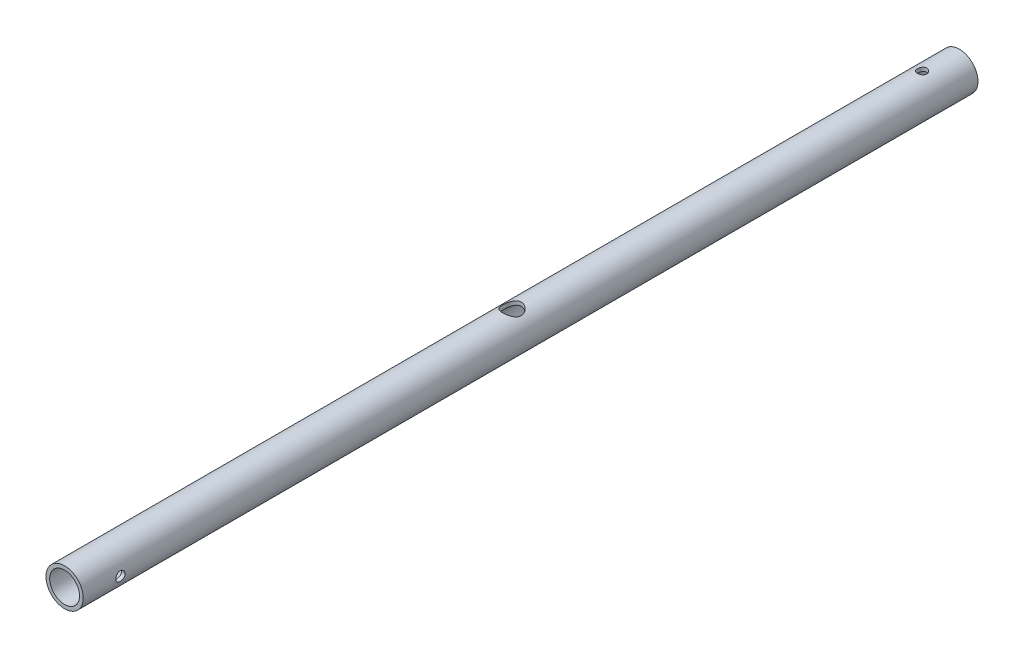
ISO-10303-21;
HEADER;
FILE_DESCRIPTION(('STEP AP214'),'2;1');
FILE_NAME('part.step','',(''),(''),'','','');
FILE_SCHEMA(('AUTOMOTIVE_DESIGN { 1 0 10303 214 1 1 1 1 }'));
ENDSEC;
DATA;
#1=APPLICATION_CONTEXT('core data for automotive mechanical design processes');
#2=APPLICATION_PROTOCOL_DEFINITION('international standard','automotive_design',2000,#1);
#3=PRODUCT_CONTEXT('',#1,'mechanical');
#4=PRODUCT('Part','Part','',(#3));
#5=PRODUCT_RELATED_PRODUCT_CATEGORY('part','',(#4));
#6=PRODUCT_DEFINITION_FORMATION('','',#4);
#7=PRODUCT_DEFINITION_CONTEXT('part definition',#1,'design');
#8=PRODUCT_DEFINITION('design','',#6,#7);
#9=PRODUCT_DEFINITION_SHAPE('','',#8);
#10=(LENGTH_UNIT() NAMED_UNIT(*) SI_UNIT(.MILLI.,.METRE.));
#11=(NAMED_UNIT(*) PLANE_ANGLE_UNIT() SI_UNIT($,.RADIAN.));
#12=(NAMED_UNIT(*) SI_UNIT($,.STERADIAN.) SOLID_ANGLE_UNIT());
#13=UNCERTAINTY_MEASURE_WITH_UNIT(LENGTH_MEASURE(1.E-05),#10,'distance_accuracy_value','');
#14=(GEOMETRIC_REPRESENTATION_CONTEXT(3) GLOBAL_UNCERTAINTY_ASSIGNED_CONTEXT((#13)) GLOBAL_UNIT_ASSIGNED_CONTEXT((#10,
#11,#12)) REPRESENTATION_CONTEXT('',''));
#15=CARTESIAN_POINT('',(0.,0.,0.));
#16=DIRECTION('',(0.,0.,1.));
#17=DIRECTION('',(1.,0.,0.));
#18=AXIS2_PLACEMENT_3D('',#15,#16,#17);
#19=CARTESIAN_POINT('',(0.,0.,609.6));
#20=DIRECTION('',(0.,0.,-1.));
#21=DIRECTION('',(-1.,0.,0.));
#22=AXIS2_PLACEMENT_3D('',#19,#20,#21);
#23=CYLINDRICAL_SURFACE('',#22,12.7);
#24=CARTESIAN_POINT('',(0.,0.,609.6));
#25=DIRECTION('',(0.,0.,1.));
#26=DIRECTION('',(1.,0.,0.));
#27=AXIS2_PLACEMENT_3D('',#24,#25,#26);
#28=CIRCLE('',#27,12.7);
#29=CARTESIAN_POINT('',(12.7,0.,609.6));
#30=VERTEX_POINT('',#29);
#31=EDGE_CURVE('E10',#30,#30,#28,.T.);
#32=ORIENTED_EDGE('',*,*,#31,.F.);
#33=EDGE_LOOP('',(#32));
#34=FACE_BOUND('',#33,.T.);
#35=CARTESIAN_POINT('',(0.,0.,0.));
#36=DIRECTION('',(0.,0.,1.));
#37=DIRECTION('',(1.,0.,0.));
#38=AXIS2_PLACEMENT_3D('',#35,#36,#37);
#39=CIRCLE('',#38,12.7);
#40=CARTESIAN_POINT('',(12.7,0.,0.));
#41=VERTEX_POINT('',#40);
#42=EDGE_CURVE('E55',#41,#41,#39,.T.);
#43=ORIENTED_EDGE('',*,*,#42,.T.);
#44=EDGE_LOOP('',(#43));
#45=FACE_BOUND('',#44,.T.);
#46=CARTESIAN_POINT('',(0.,-12.7,298.45));
#47=CARTESIAN_POINT('',(0.166990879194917,-12.6999994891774,298.450000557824));
#48=CARTESIAN_POINT('',(0.333993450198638,-12.6966986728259,298.456594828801));
#49=CARTESIAN_POINT('',(0.66676852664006,-12.6835786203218,298.482896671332));
#50=CARTESIAN_POINT('',(0.83254046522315,-12.6737565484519,298.502609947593));
#51=CARTESIAN_POINT('',(1.16177467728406,-12.6478292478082,298.554953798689));
#52=CARTESIAN_POINT('',(1.32523331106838,-12.6317150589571,298.587602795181));
#53=CARTESIAN_POINT('',(1.64849348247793,-12.5936085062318,298.665456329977));
#54=CARTESIAN_POINT('',(1.80829349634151,-12.5716137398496,298.710666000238));
#55=CARTESIAN_POINT('',(2.12244180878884,-12.5223959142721,298.812938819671));
#56=CARTESIAN_POINT('',(2.27681076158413,-12.4951959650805,298.869949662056));
#57=CARTESIAN_POINT('',(2.57993454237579,-12.4361502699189,298.995399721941));
#58=CARTESIAN_POINT('',(2.72868724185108,-12.4043027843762,299.063843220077));
#59=CARTESIAN_POINT('',(3.16512812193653,-12.3028811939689,299.285408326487));
#60=CARTESIAN_POINT('',(3.44334503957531,-12.2273713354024,299.454878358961));
#61=CARTESIAN_POINT('',(3.98471796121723,-12.062218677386,299.843942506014));
#62=CARTESIAN_POINT('',(4.24594454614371,-11.9719972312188,300.065948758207));
#63=CARTESIAN_POINT('',(4.72936553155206,-11.7893960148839,300.548851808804));
#64=CARTESIAN_POINT('',(4.95153018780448,-11.6970146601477,300.809777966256));
#65=CARTESIAN_POINT('',(5.25955398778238,-11.5603243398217,301.237175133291));
#66=CARTESIAN_POINT('',(5.3610627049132,-11.5134721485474,301.391796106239));
#67=CARTESIAN_POINT('',(5.55058368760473,-11.4233099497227,301.710052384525));
#68=CARTESIAN_POINT('',(5.63860158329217,-11.3799984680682,301.87368389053));
#69=CARTESIAN_POINT('',(5.80035808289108,-11.2984098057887,302.209052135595));
#70=CARTESIAN_POINT('',(5.87409762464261,-11.2601322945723,302.380788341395));
#71=CARTESIAN_POINT('',(6.00645788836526,-11.1900882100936,302.7311830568));
#72=CARTESIAN_POINT('',(6.06508754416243,-11.1583177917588,302.909837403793));
#73=CARTESIAN_POINT('',(6.16347180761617,-11.104259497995,303.261976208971));
#74=CARTESIAN_POINT('',(6.2041424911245,-11.08151961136,303.435135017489));
#75=CARTESIAN_POINT('',(6.2708994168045,-11.0438804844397,303.785089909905));
#76=CARTESIAN_POINT('',(6.29698628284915,-11.0289809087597,303.961885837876));
#77=CARTESIAN_POINT('',(6.33415533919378,-11.0076763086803,304.317409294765));
#78=CARTESIAN_POINT('',(6.34525022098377,-11.0012640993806,304.496135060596));
#79=CARTESIAN_POINT('',(6.35229110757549,-10.9972004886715,304.853976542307));
#80=CARTESIAN_POINT('',(6.34823855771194,-10.9995482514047,305.033092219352));
#81=CARTESIAN_POINT('',(6.32645177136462,-11.012090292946,305.368582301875));
#82=CARTESIAN_POINT('',(6.31041699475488,-11.0213095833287,305.525107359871));
#83=CARTESIAN_POINT('',(6.26687134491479,-11.046128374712,305.836090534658));
#84=CARTESIAN_POINT('',(6.23935668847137,-11.0617299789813,305.990547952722));
#85=CARTESIAN_POINT('',(6.17316873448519,-11.0988027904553,306.296311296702));
#86=CARTESIAN_POINT('',(6.13449690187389,-11.120273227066,306.44761763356));
#87=CARTESIAN_POINT('',(6.04639785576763,-11.1684190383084,306.746238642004));
#88=CARTESIAN_POINT('',(5.99696641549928,-11.1950964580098,306.893551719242));
#89=CARTESIAN_POINT('',(5.83067999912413,-11.2831376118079,307.334928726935));
#90=CARTESIAN_POINT('',(5.69733157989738,-11.351625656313,307.621550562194));
#91=CARTESIAN_POINT('',(5.39139880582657,-11.500071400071,308.169576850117));
#92=CARTESIAN_POINT('',(5.21879682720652,-11.5800342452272,308.43096990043));
#93=CARTESIAN_POINT('',(4.81373716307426,-11.7546812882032,308.956187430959));
#94=CARTESIAN_POINT('',(4.57646495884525,-11.8499465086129,309.216117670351));
#95=CARTESIAN_POINT('',(4.06112275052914,-12.0362854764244,309.694203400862));
#96=CARTESIAN_POINT('',(3.78303336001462,-12.1273572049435,309.912338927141));
#97=CARTESIAN_POINT('',(3.33286643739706,-12.255938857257,310.208221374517));
#98=CARTESIAN_POINT('',(3.17335722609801,-12.2983050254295,310.303359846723));
#99=CARTESIAN_POINT('',(2.84569771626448,-12.3782218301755,310.479706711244));
#100=CARTESIAN_POINT('',(2.67755134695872,-12.4157746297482,310.560921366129));
#101=CARTESIAN_POINT('',(2.3337876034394,-12.4849579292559,310.708546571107));
#102=CARTESIAN_POINT('',(2.15817316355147,-12.5165907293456,310.774962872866));
#103=CARTESIAN_POINT('',(1.80074808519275,-12.5729876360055,310.892221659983));
#104=CARTESIAN_POINT('',(1.61893816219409,-12.5977525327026,310.943065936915));
#105=CARTESIAN_POINT('',(1.26593635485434,-12.6378915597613,311.024946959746));
#106=CARTESIAN_POINT('',(1.09511243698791,-12.6538736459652,311.057275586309));
#107=CARTESIAN_POINT('',(0.750891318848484,-12.6789562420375,311.107845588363));
#108=CARTESIAN_POINT('',(0.577494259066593,-12.6880571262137,311.1260877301));
#109=CARTESIAN_POINT('',(0.229629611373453,-12.6991158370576,311.1482387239));
#110=CARTESIAN_POINT('',(0.0551624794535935,-12.7010765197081,311.152153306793));
#111=CARTESIAN_POINT('',(-0.293430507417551,-12.6978059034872,311.145611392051));
#112=CARTESIAN_POINT('',(-0.467556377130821,-12.6925749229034,311.13515553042));
#113=CARTESIAN_POINT('',(-0.800509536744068,-12.6757555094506,311.10138636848));
#114=CARTESIAN_POINT('',(-0.959472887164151,-12.6646934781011,311.079136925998));
#115=CARTESIAN_POINT('',(-1.27482840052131,-12.6368459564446,311.022778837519));
#116=CARTESIAN_POINT('',(-1.43121967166,-12.6200585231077,310.988666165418));
#117=CARTESIAN_POINT('',(-1.74030776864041,-12.581159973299,310.908952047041));
#118=CARTESIAN_POINT('',(-1.89300576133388,-12.5590505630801,310.863354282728));
#119=CARTESIAN_POINT('',(-2.19390570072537,-12.5099971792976,310.761085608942));
#120=CARTESIAN_POINT('',(-2.34210587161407,-12.4830513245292,310.704410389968));
#121=CARTESIAN_POINT('',(-2.63725856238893,-12.4240951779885,310.578737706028));
#122=CARTESIAN_POINT('',(-2.78405822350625,-12.3919635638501,310.509437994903));
#123=CARTESIAN_POINT('',(-3.07126756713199,-12.32392525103,310.360218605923));
#124=CARTESIAN_POINT('',(-3.21167506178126,-12.2880172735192,310.280295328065));
#125=CARTESIAN_POINT('',(-3.62227376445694,-12.1757741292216,310.025450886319));
#126=CARTESIAN_POINT('',(-3.88199540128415,-12.0948877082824,309.835388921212));
#127=CARTESIAN_POINT('',(-4.39279994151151,-11.9194499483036,309.398860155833));
#128=CARTESIAN_POINT('',(-4.64052990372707,-11.8243367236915,309.148687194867));
#129=CARTESIAN_POINT('',(-4.97892395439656,-11.6839772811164,308.745089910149));
#130=CARTESIAN_POINT('',(-5.08625380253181,-11.6375432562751,308.60572389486));
#131=CARTESIAN_POINT('',(-5.28929908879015,-11.5466734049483,308.318066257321));
#132=CARTESIAN_POINT('',(-5.38501278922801,-11.5022378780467,308.169773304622));
#133=CARTESIAN_POINT('',(-5.56849389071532,-11.4145838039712,307.857571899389));
#134=CARTESIAN_POINT('',(-5.65564549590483,-11.3715304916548,307.693254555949));
#135=CARTESIAN_POINT('',(-5.81556909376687,-11.290579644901,307.3566294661));
#136=CARTESIAN_POINT('',(-5.88834801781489,-11.2526796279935,307.184325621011));
#137=CARTESIAN_POINT('',(-6.01870593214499,-11.1834979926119,306.832920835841));
#138=CARTESIAN_POINT('',(-6.07629712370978,-11.1522110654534,306.653825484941));
#139=CARTESIAN_POINT('',(-6.17556605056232,-11.0975495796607,306.29010166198));
#140=CARTESIAN_POINT('',(-6.21724624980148,-11.0741737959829,306.105474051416));
#141=CARTESIAN_POINT('',(-6.28083303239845,-11.038221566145,305.750261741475));
#142=CARTESIAN_POINT('',(-6.30425367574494,-11.0248238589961,305.580030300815));
#143=CARTESIAN_POINT('',(-6.33722186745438,-11.0059068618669,305.237794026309));
#144=CARTESIAN_POINT('',(-6.34677035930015,-11.0003870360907,305.065789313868));
#145=CARTESIAN_POINT('',(-6.35184755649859,-10.9974561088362,304.721568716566));
#146=CARTESIAN_POINT('',(-6.34738144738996,-11.0000420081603,304.549352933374));
#147=CARTESIAN_POINT('',(-6.32451076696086,-11.0132073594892,304.206166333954));
#148=CARTESIAN_POINT('',(-6.30610676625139,-11.023786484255,304.035195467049));
#149=CARTESIAN_POINT('',(-6.2580492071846,-11.0511312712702,303.712170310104));
#150=CARTESIAN_POINT('',(-6.22963986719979,-11.0672085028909,303.559870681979));
#151=CARTESIAN_POINT('',(-6.16196939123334,-11.1050268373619,303.258399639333));
#152=CARTESIAN_POINT('',(-6.12270465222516,-11.1267698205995,303.109229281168));
#153=CARTESIAN_POINT('',(-5.98919755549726,-11.1995485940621,302.667775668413));
#154=CARTESIAN_POINT('',(-5.87921095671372,-11.2581531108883,302.381342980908));
#155=CARTESIAN_POINT('',(-5.61221709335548,-11.3937155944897,301.811483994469));
#156=CARTESIAN_POINT('',(-5.45254719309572,-11.4716421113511,301.529552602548));
#157=CARTESIAN_POINT('',(-5.09367320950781,-11.635439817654,300.99462692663));
#158=CARTESIAN_POINT('',(-4.8944485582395,-11.7213151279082,300.741647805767));
#159=CARTESIAN_POINT('',(-4.43354035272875,-11.9038699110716,300.239761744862));
#160=CARTESIAN_POINT('',(-4.16720894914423,-12.0005943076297,299.995084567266));
#161=CARTESIAN_POINT('',(-3.73813634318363,-12.1383310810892,299.663693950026));
#162=CARTESIAN_POINT('',(-3.59004569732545,-12.1830529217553,299.559094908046));
#163=CARTESIAN_POINT('',(-3.28473589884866,-12.2688872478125,299.362544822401));
#164=CARTESIAN_POINT('',(-3.12752095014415,-12.3100013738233,299.270588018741));
#165=CARTESIAN_POINT('',(-2.80361177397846,-12.3878055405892,299.099466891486));
#166=CARTESIAN_POINT('',(-2.63685404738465,-12.4244591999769,299.020406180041));
#167=CARTESIAN_POINT('',(-2.29614399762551,-12.4919115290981,298.876793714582));
#168=CARTESIAN_POINT('',(-2.12219525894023,-12.5227130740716,298.812234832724));
#169=CARTESIAN_POINT('',(-1.76872534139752,-12.5775008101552,298.69848325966));
#170=CARTESIAN_POINT('',(-1.58921727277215,-12.6015018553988,298.649257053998));
#171=CARTESIAN_POINT('',(-1.22585054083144,-12.642019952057,298.566664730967));
#172=CARTESIAN_POINT('',(-1.04199460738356,-12.6585415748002,298.533288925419));
#173=CARTESIAN_POINT('',(-0.715063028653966,-12.6806500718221,298.488767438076));
#174=CARTESIAN_POINT('',(-0.57254881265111,-12.6878936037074,298.474242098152));
#175=CARTESIAN_POINT('',(-0.286692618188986,-12.6975688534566,298.454858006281));
#176=CARTESIAN_POINT('',(-0.143350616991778,-12.7000004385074,298.449999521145));
#177=CARTESIAN_POINT('',(0.,-12.7,298.45));
#178=B_SPLINE_CURVE_WITH_KNOTS('',3,(#46,#47,#48,#49,#50,#51,#52,#53,#54,#55,#56,#57,#58,#59,
#60,#61,#62,#63,#64,#65,#66,#67,#68,#69,#70,#71,#72,#73,#74,#75,#76,#77,#78,#79,#80,#81,#82,#83,
#84,#85,#86,#87,#88,#89,#90,#91,#92,#93,#94,#95,#96,#97,#98,#99,#100,#101,#102,#103,#104,#105,
#106,#107,#108,#109,#110,#111,#112,#113,#114,#115,#116,#117,#118,#119,#120,#121,#122,#123,#124,
#125,#126,#127,#128,#129,#130,#131,#132,#133,#134,#135,#136,#137,#138,#139,#140,#141,#142,#143,
#144,#145,#146,#147,#148,#149,#150,#151,#152,#153,#154,#155,#156,#157,#158,#159,#160,#161,#162,
#163,#164,#165,#166,#167,#168,#169,#170,#171,#172,#173,#174,#175,#176,#177),.UNSPECIFIED.,.T.,
.F.,(4,2,2,2,2,2,2,2,2,2,2,2,2,2,2,2,2,2,2,2,2,2,2,2,2,2,2,2,2,2,2,2,2,2,2,2,2,2,2,2,2,2,2,2,2,
2,2,2,2,2,2,2,2,2,2,2,2,2,2,2,2,2,2,2,2,4),(0.,0.500831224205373,1.00188037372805,
1.50364564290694,2.00561622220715,2.50540779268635,3.00538691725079,4.00425210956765,
5.06354639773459,6.12364383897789,6.69546056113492,7.26703799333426,7.83857787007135,
8.40977904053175,8.94696617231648,9.48413032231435,10.0208394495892,10.5574973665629,
11.0297819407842,11.5022222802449,11.9746006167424,12.4471648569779,13.4133450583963,
14.3799599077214,15.4691385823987,16.5588362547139,17.1296896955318,17.7002857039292,
18.2706595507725,18.840967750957,19.3640345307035,19.8870728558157,20.4099019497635,
20.9327079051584,21.4148301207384,21.8971161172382,22.3792476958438,22.8615672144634,
23.3574791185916,23.8535595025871,24.8452132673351,25.934248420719,26.4795520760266,
27.0249372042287,27.5969396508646,28.1686655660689,28.7399307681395,29.3111074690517,
29.827455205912,30.3437678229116,30.8598894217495,31.3759898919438,31.8427315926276,
32.3096283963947,33.2427989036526,34.2386648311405,35.2350499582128,36.3525027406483,
36.9121724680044,37.4715863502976,38.0352942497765,38.5987244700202,39.1609143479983,
39.7227601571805,40.1526787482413,40.5826092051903),.UNSPECIFIED.);
#179=CARTESIAN_POINT('',(0.,-12.7,298.45));
#180=VERTEX_POINT('',#179);
#181=EDGE_CURVE('E98',#180,#180,#178,.T.);
#182=ORIENTED_EDGE('',*,*,#181,.F.);
#183=EDGE_LOOP('',(#182));
#184=FACE_BOUND('',#183,.T.);
#185=CARTESIAN_POINT('',(0.,12.7,298.45));
#186=CARTESIAN_POINT('',(-0.166990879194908,12.6999994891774,298.450000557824));
#187=CARTESIAN_POINT('',(-0.333993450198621,12.6966986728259,298.456594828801));
#188=CARTESIAN_POINT('',(-0.666768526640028,12.6835786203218,298.482896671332));
#189=CARTESIAN_POINT('',(-0.832540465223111,12.6737565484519,298.502609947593));
#190=CARTESIAN_POINT('',(-1.16177467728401,12.6478292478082,298.554953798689));
#191=CARTESIAN_POINT('',(-1.32523331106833,12.6317150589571,298.587602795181));
#192=CARTESIAN_POINT('',(-1.64849348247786,12.5936085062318,298.665456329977));
#193=CARTESIAN_POINT('',(-1.80829349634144,12.5716137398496,298.710666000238));
#194=CARTESIAN_POINT('',(-2.12244180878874,12.5223959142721,298.812938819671));
#195=CARTESIAN_POINT('',(-2.27681076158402,12.4951959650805,298.869949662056));
#196=CARTESIAN_POINT('',(-2.57993454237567,12.436150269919,298.995399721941));
#197=CARTESIAN_POINT('',(-2.72868724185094,12.4043027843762,299.063843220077));
#198=CARTESIAN_POINT('',(-3.16512812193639,12.302881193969,299.285408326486));
#199=CARTESIAN_POINT('',(-3.44334503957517,12.2273713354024,299.454878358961));
#200=CARTESIAN_POINT('',(-3.98471796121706,12.0622186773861,299.843942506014));
#201=CARTESIAN_POINT('',(-4.24594454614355,11.9719972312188,300.065948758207));
#202=CARTESIAN_POINT('',(-4.72936553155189,11.789396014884,300.548851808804));
#203=CARTESIAN_POINT('',(-4.95153018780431,11.6970146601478,300.809777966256));
#204=CARTESIAN_POINT('',(-5.25955398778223,11.5603243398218,301.237175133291));
#205=CARTESIAN_POINT('',(-5.36106270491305,11.5134721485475,301.391796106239));
#206=CARTESIAN_POINT('',(-5.5505836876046,11.4233099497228,301.710052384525));
#207=CARTESIAN_POINT('',(-5.63860158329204,11.3799984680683,301.87368389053));
#208=CARTESIAN_POINT('',(-5.80035808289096,11.2984098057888,302.209052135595));
#209=CARTESIAN_POINT('',(-5.8740976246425,11.2601322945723,302.380788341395));
#210=CARTESIAN_POINT('',(-6.00645788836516,11.1900882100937,302.7311830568));
#211=CARTESIAN_POINT('',(-6.06508754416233,11.1583177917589,302.909837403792));
#212=CARTESIAN_POINT('',(-6.16347180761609,11.104259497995,303.26197620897));
#213=CARTESIAN_POINT('',(-6.20414249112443,11.08151961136,303.435135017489));
#214=CARTESIAN_POINT('',(-6.27089941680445,11.0438804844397,303.785089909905));
#215=CARTESIAN_POINT('',(-6.29698628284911,11.0289809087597,303.961885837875));
#216=CARTESIAN_POINT('',(-6.33415533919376,11.0076763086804,304.317409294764));
#217=CARTESIAN_POINT('',(-6.34525022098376,11.0012640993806,304.496135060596));
#218=CARTESIAN_POINT('',(-6.35229110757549,10.9972004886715,304.853976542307));
#219=CARTESIAN_POINT('',(-6.34823855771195,10.9995482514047,305.033092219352));
#220=CARTESIAN_POINT('',(-6.32645177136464,11.012090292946,305.368582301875));
#221=CARTESIAN_POINT('',(-6.3104169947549,11.0213095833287,305.52510735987));
#222=CARTESIAN_POINT('',(-6.26687134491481,11.046128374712,305.836090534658));
#223=CARTESIAN_POINT('',(-6.23935668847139,11.0617299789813,305.990547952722));
#224=CARTESIAN_POINT('',(-6.1731687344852,11.0988027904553,306.296311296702));
#225=CARTESIAN_POINT('',(-6.13449690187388,11.120273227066,306.44761763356));
#226=CARTESIAN_POINT('',(-6.04639785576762,11.1684190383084,306.746238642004));
#227=CARTESIAN_POINT('',(-5.99696641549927,11.1950964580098,306.893551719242));
#228=CARTESIAN_POINT('',(-5.83067999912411,11.2831376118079,307.334928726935));
#229=CARTESIAN_POINT('',(-5.69733157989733,11.351625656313,307.621550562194));
#230=CARTESIAN_POINT('',(-5.3913988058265,11.500071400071,308.169576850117));
#231=CARTESIAN_POINT('',(-5.21879682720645,11.5800342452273,308.43096990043));
#232=CARTESIAN_POINT('',(-4.81373716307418,11.7546812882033,308.956187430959));
#233=CARTESIAN_POINT('',(-4.57646495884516,11.8499465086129,309.216117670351));
#234=CARTESIAN_POINT('',(-4.06112275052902,12.0362854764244,309.694203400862));
#235=CARTESIAN_POINT('',(-3.78303336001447,12.1273572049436,309.912338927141));
#236=CARTESIAN_POINT('',(-3.33286643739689,12.2559388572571,310.208221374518));
#237=CARTESIAN_POINT('',(-3.17335722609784,12.2983050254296,310.303359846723));
#238=CARTESIAN_POINT('',(-2.8456977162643,12.3782218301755,310.479706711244));
#239=CARTESIAN_POINT('',(-2.67755134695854,12.4157746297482,310.56092136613));
#240=CARTESIAN_POINT('',(-2.33378760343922,12.484957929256,310.708546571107));
#241=CARTESIAN_POINT('',(-2.15817316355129,12.5165907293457,310.774962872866));
#242=CARTESIAN_POINT('',(-1.80074808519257,12.5729876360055,310.892221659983));
#243=CARTESIAN_POINT('',(-1.61893816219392,12.5977525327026,310.943065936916));
#244=CARTESIAN_POINT('',(-1.2659363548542,12.6378915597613,311.024946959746));
#245=CARTESIAN_POINT('',(-1.09511243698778,12.6538736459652,311.057275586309));
#246=CARTESIAN_POINT('',(-0.750891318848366,12.6789562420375,311.107845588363));
#247=CARTESIAN_POINT('',(-0.57749425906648,12.6880571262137,311.1260877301));
#248=CARTESIAN_POINT('',(-0.229629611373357,12.6991158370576,311.1482387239));
#249=CARTESIAN_POINT('',(-0.0551624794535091,12.7010765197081,311.152153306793));
#250=CARTESIAN_POINT('',(0.293430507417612,12.6978059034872,311.145611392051));
#251=CARTESIAN_POINT('',(0.46755637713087,12.6925749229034,311.13515553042));
#252=CARTESIAN_POINT('',(0.800509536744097,12.6757555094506,311.10138636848));
#253=CARTESIAN_POINT('',(0.959472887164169,12.6646934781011,311.079136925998));
#254=CARTESIAN_POINT('',(1.27482840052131,12.6368459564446,311.022778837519));
#255=CARTESIAN_POINT('',(1.43121967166,12.6200585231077,310.988666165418));
#256=CARTESIAN_POINT('',(1.74030776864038,12.581159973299,310.908952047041));
#257=CARTESIAN_POINT('',(1.89300576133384,12.5590505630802,310.863354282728));
#258=CARTESIAN_POINT('',(2.19390570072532,12.5099971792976,310.761085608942));
#259=CARTESIAN_POINT('',(2.34210587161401,12.4830513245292,310.704410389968));
#260=CARTESIAN_POINT('',(2.63725856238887,12.4240951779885,310.578737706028));
#261=CARTESIAN_POINT('',(2.78405822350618,12.3919635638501,310.509437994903));
#262=CARTESIAN_POINT('',(3.07126756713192,12.32392525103,310.360218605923));
#263=CARTESIAN_POINT('',(3.21167506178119,12.2880172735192,310.280295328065));
#264=CARTESIAN_POINT('',(3.62227376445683,12.1757741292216,310.025450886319));
#265=CARTESIAN_POINT('',(3.88199540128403,12.0948877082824,309.835388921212));
#266=CARTESIAN_POINT('',(4.39279994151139,11.9194499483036,309.398860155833));
#267=CARTESIAN_POINT('',(4.64052990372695,11.8243367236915,309.148687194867));
#268=CARTESIAN_POINT('',(4.97892395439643,11.6839772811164,308.745089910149));
#269=CARTESIAN_POINT('',(5.08625380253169,11.6375432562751,308.60572389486));
#270=CARTESIAN_POINT('',(5.28929908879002,11.5466734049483,308.318066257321));
#271=CARTESIAN_POINT('',(5.38501278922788,11.5022378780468,308.169773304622));
#272=CARTESIAN_POINT('',(5.56849389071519,11.4145838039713,307.857571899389));
#273=CARTESIAN_POINT('',(5.65564549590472,11.3715304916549,307.69325455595));
#274=CARTESIAN_POINT('',(5.81556909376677,11.290579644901,307.3566294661));
#275=CARTESIAN_POINT('',(5.8883480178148,11.2526796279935,307.184325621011));
#276=CARTESIAN_POINT('',(6.01870593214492,11.183497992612,306.832920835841));
#277=CARTESIAN_POINT('',(6.07629712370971,11.1522110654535,306.653825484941));
#278=CARTESIAN_POINT('',(6.17556605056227,11.0975495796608,306.29010166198));
#279=CARTESIAN_POINT('',(6.21724624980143,11.0741737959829,306.105474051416));
#280=CARTESIAN_POINT('',(6.28083303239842,11.038221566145,305.750261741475));
#281=CARTESIAN_POINT('',(6.30425367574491,11.0248238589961,305.580030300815));
#282=CARTESIAN_POINT('',(6.33722186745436,11.0059068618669,305.237794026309));
#283=CARTESIAN_POINT('',(6.34677035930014,11.0003870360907,305.065789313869));
#284=CARTESIAN_POINT('',(6.3518475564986,10.9974561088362,304.721568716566));
#285=CARTESIAN_POINT('',(6.34738144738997,11.0000420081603,304.549352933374));
#286=CARTESIAN_POINT('',(6.32451076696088,11.0132073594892,304.206166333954));
#287=CARTESIAN_POINT('',(6.30610676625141,11.023786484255,304.035195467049));
#288=CARTESIAN_POINT('',(6.25804920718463,11.0511312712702,303.712170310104));
#289=CARTESIAN_POINT('',(6.22963986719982,11.0672085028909,303.559870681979));
#290=CARTESIAN_POINT('',(6.16196939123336,11.1050268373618,303.258399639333));
#291=CARTESIAN_POINT('',(6.12270465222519,11.1267698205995,303.109229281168));
#292=CARTESIAN_POINT('',(5.98919755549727,11.1995485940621,302.667775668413));
#293=CARTESIAN_POINT('',(5.87921095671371,11.2581531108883,302.381342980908));
#294=CARTESIAN_POINT('',(5.61221709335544,11.3937155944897,301.811483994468));
#295=CARTESIAN_POINT('',(5.45254719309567,11.4716421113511,301.529552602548));
#296=CARTESIAN_POINT('',(5.09367320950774,11.635439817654,300.994626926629));
#297=CARTESIAN_POINT('',(4.89444855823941,11.7213151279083,300.741647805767));
#298=CARTESIAN_POINT('',(4.43354035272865,11.9038699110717,300.239761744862));
#299=CARTESIAN_POINT('',(4.16720894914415,12.0005943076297,299.995084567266));
#300=CARTESIAN_POINT('',(3.73813634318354,12.1383310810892,299.663693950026));
#301=CARTESIAN_POINT('',(3.59004569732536,12.1830529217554,299.559094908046));
#302=CARTESIAN_POINT('',(3.28473589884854,12.2688872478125,299.362544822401));
#303=CARTESIAN_POINT('',(3.12752095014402,12.3100013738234,299.270588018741));
#304=CARTESIAN_POINT('',(2.80361177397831,12.3878055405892,299.099466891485));
#305=CARTESIAN_POINT('',(2.63685404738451,12.4244591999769,299.020406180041));
#306=CARTESIAN_POINT('',(2.29614399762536,12.4919115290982,298.876793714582));
#307=CARTESIAN_POINT('',(2.12219525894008,12.5227130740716,298.812234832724));
#308=CARTESIAN_POINT('',(1.76872534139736,12.5775008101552,298.69848325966));
#309=CARTESIAN_POINT('',(1.589217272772,12.6015018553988,298.649257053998));
#310=CARTESIAN_POINT('',(1.2258505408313,12.642019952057,298.566664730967));
#311=CARTESIAN_POINT('',(1.04199460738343,12.6585415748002,298.533288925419));
#312=CARTESIAN_POINT('',(0.715063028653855,12.6806500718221,298.488767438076));
#313=CARTESIAN_POINT('',(0.572548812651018,12.6878936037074,298.474242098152));
#314=CARTESIAN_POINT('',(0.286692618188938,12.6975688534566,298.454858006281));
#315=CARTESIAN_POINT('',(0.143350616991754,12.7000004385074,298.449999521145));
#316=CARTESIAN_POINT('',(0.,12.7,298.45));
#317=B_SPLINE_CURVE_WITH_KNOTS('',3,(#185,#186,#187,#188,#189,#190,#191,#192,#193,#194,#195,
#196,#197,#198,#199,#200,#201,#202,#203,#204,#205,#206,#207,#208,#209,#210,#211,#212,#213,#214,
#215,#216,#217,#218,#219,#220,#221,#222,#223,#224,#225,#226,#227,#228,#229,#230,#231,#232,#233,
#234,#235,#236,#237,#238,#239,#240,#241,#242,#243,#244,#245,#246,#247,#248,#249,#250,#251,#252,
#253,#254,#255,#256,#257,#258,#259,#260,#261,#262,#263,#264,#265,#266,#267,#268,#269,#270,#271,
#272,#273,#274,#275,#276,#277,#278,#279,#280,#281,#282,#283,#284,#285,#286,#287,#288,#289,#290,
#291,#292,#293,#294,#295,#296,#297,#298,#299,#300,#301,#302,#303,#304,#305,#306,#307,#308,#309,
#310,#311,#312,#313,#314,#315,#316),.UNSPECIFIED.,.T.,.F.,(4,2,2,2,2,2,2,2,2,2,2,2,2,2,2,2,2,2,
2,2,2,2,2,2,2,2,2,2,2,2,2,2,2,2,2,2,2,2,2,2,2,2,2,2,2,2,2,2,2,2,2,2,2,2,2,2,2,2,2,2,2,2,2,2,2,
4),(0.,0.500831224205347,1.00188037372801,1.50364564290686,2.00561622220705,2.50540779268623,
3.00538691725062,4.00425210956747,5.06354639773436,6.12364383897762,6.69546056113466,
7.26703799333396,7.83857787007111,8.40977904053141,8.94696617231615,9.48413032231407,
10.0208394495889,10.5574973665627,11.029781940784,11.5022222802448,11.9746006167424,
12.447164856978,13.4133450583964,14.3799599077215,15.4691385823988,16.5588362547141,
17.129689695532,17.7002857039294,18.2706595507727,18.8409677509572,19.3640345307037,
19.8870728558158,20.4099019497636,20.9327079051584,21.4148301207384,21.8971161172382,
22.3792476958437,22.8615672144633,23.3574791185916,23.8535595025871,24.845213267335,
25.9342484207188,26.4795520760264,27.0249372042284,27.5969396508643,28.1686655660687,
28.7399307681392,29.3111074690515,29.8274552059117,30.3437678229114,30.8598894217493,
31.3759898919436,31.8427315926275,32.3096283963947,33.2427989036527,34.2386648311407,
35.235049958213,36.3525027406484,36.9121724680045,37.4715863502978,38.0352942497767,
38.5987244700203,39.1609143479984,39.7227601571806,40.1526787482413,40.5826092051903),.UNSPECIFIED.);
#318=CARTESIAN_POINT('',(0.,12.7,298.45));
#319=VERTEX_POINT('',#318);
#320=EDGE_CURVE('E105',#319,#319,#317,.T.);
#321=ORIENTED_EDGE('',*,*,#320,.F.);
#322=EDGE_LOOP('',(#321));
#323=FACE_BOUND('',#322,.T.);
#324=CARTESIAN_POINT('',(0.,-12.7,22.225));
#325=CARTESIAN_POINT('',(0.175421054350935,-12.6999970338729,22.2250049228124));
#326=CARTESIAN_POINT('',(0.350897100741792,-12.6963292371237,22.2395871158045));
#327=CARTESIAN_POINT('',(0.69682005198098,-12.6820530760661,22.2974432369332));
#328=CARTESIAN_POINT('',(0.867264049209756,-12.6714407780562,22.3407334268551));
#329=CARTESIAN_POINT('',(1.19807751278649,-12.6444507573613,22.4545297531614));
#330=CARTESIAN_POINT('',(1.35845880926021,-12.6280799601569,22.5250032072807));
#331=CARTESIAN_POINT('',(1.66512267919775,-12.591316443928,22.6910506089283));
#332=CARTESIAN_POINT('',(1.81140477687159,-12.5709235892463,22.7866254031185));
#333=CARTESIAN_POINT('',(2.08873074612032,-12.5278602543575,23.0022416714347));
#334=CARTESIAN_POINT('',(2.21944287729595,-12.5051546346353,23.1227028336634));
#335=CARTESIAN_POINT('',(2.45903522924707,-12.4602582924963,23.3837738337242));
#336=CARTESIAN_POINT('',(2.56791298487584,-12.4380676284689,23.5243859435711));
#337=CARTESIAN_POINT('',(2.76230618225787,-12.3963594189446,23.8243432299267));
#338=CARTESIAN_POINT('',(2.84745052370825,-12.3768864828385,23.9839356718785));
#339=CARTESIAN_POINT('',(2.98957345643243,-12.343330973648,24.3157341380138));
#340=CARTESIAN_POINT('',(3.04655655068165,-12.3292475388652,24.4879381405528));
#341=CARTESIAN_POINT('',(3.12960773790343,-12.3084267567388,24.8364237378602));
#342=CARTESIAN_POINT('',(3.15627230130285,-12.3015478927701,25.0125545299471));
#343=CARTESIAN_POINT('',(3.17978742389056,-12.2954915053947,25.3669134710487));
#344=CARTESIAN_POINT('',(3.176642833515,-12.2963127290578,25.5451412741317));
#345=CARTESIAN_POINT('',(3.14110481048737,-12.3054365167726,25.8940634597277));
#346=CARTESIAN_POINT('',(3.1094221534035,-12.3135572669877,26.0648357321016));
#347=CARTESIAN_POINT('',(3.01884119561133,-12.3360753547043,26.3985608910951));
#348=CARTESIAN_POINT('',(2.95994095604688,-12.3504731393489,26.5615132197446));
#349=CARTESIAN_POINT('',(2.81599106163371,-12.3840899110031,26.876878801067));
#350=CARTESIAN_POINT('',(2.73068344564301,-12.4033560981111,27.0291690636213));
#351=CARTESIAN_POINT('',(2.53652078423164,-12.4445122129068,27.3175279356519));
#352=CARTESIAN_POINT('',(2.42766161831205,-12.4664025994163,27.4535937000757));
#353=CARTESIAN_POINT('',(2.1858042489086,-12.5111061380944,27.7097143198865));
#354=CARTESIAN_POINT('',(2.05220624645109,-12.533927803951,27.8292020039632));
#355=CARTESIAN_POINT('',(1.76659522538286,-12.5773596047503,28.0441849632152));
#356=CARTESIAN_POINT('',(1.61458164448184,-12.5979696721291,28.1396795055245));
#357=CARTESIAN_POINT('',(1.29564529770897,-12.6347586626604,28.3041737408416));
#358=CARTESIAN_POINT('',(1.12867311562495,-12.6509221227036,28.3730813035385));
#359=CARTESIAN_POINT('',(0.785020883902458,-12.676884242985,28.4816916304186));
#360=CARTESIAN_POINT('',(0.608342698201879,-12.6866841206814,28.5213999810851));
#361=CARTESIAN_POINT('',(0.255142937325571,-12.6986347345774,28.5696185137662));
#362=CARTESIAN_POINT('',(0.078733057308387,-12.7009747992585,28.5789010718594));
#363=CARTESIAN_POINT('',(-0.273119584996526,-12.6982813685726,28.5681229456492));
#364=CARTESIAN_POINT('',(-0.448562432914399,-12.6932485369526,28.5480649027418));
#365=CARTESIAN_POINT('',(-0.790816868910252,-12.6764961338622,28.4798115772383));
#366=CARTESIAN_POINT('',(-0.95771783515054,-12.6648767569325,28.4320376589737));
#367=CARTESIAN_POINT('',(-1.28112793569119,-12.6362609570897,28.3101900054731));
#368=CARTESIAN_POINT('',(-1.43763601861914,-12.6192639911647,28.2361136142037));
#369=CARTESIAN_POINT('',(-1.73889063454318,-12.5813250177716,28.0622668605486));
#370=CARTESIAN_POINT('',(-1.88337918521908,-12.5603183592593,27.9620638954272));
#371=CARTESIAN_POINT('',(-2.15376466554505,-12.5167921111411,27.7393613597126));
#372=CARTESIAN_POINT('',(-2.27965837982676,-12.4942722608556,27.6168579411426));
#373=CARTESIAN_POINT('',(-2.51246336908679,-12.4495762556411,27.3494458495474));
#374=CARTESIAN_POINT('',(-2.61883285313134,-12.4274221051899,27.2040610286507));
#375=CARTESIAN_POINT('',(-2.80566443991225,-12.3865825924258,26.8970492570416));
#376=CARTESIAN_POINT('',(-2.88612769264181,-12.3678970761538,26.7354230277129));
#377=CARTESIAN_POINT('',(-3.01826384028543,-12.3363163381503,26.401382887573));
#378=CARTESIAN_POINT('',(-3.07010730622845,-12.3233869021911,26.229039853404));
#379=CARTESIAN_POINT('',(-3.14398164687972,-12.3047494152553,25.8777112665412));
#380=CARTESIAN_POINT('',(-3.16601904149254,-12.299039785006,25.6987271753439));
#381=CARTESIAN_POINT('',(-3.17931501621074,-12.2956087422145,25.3447104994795));
#382=CARTESIAN_POINT('',(-3.17143955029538,-12.2976625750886,25.1697120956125));
#383=CARTESIAN_POINT('',(-3.12711523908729,-12.3090074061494,24.8236234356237));
#384=CARTESIAN_POINT('',(-3.09066696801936,-12.3182982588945,24.6525331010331));
#385=CARTESIAN_POINT('',(-2.99070462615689,-12.3429450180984,24.3200587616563));
#386=CARTESIAN_POINT('',(-2.92735297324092,-12.3582644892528,24.1586230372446));
#387=CARTESIAN_POINT('',(-2.77551073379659,-12.3932474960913,23.8485566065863));
#388=CARTESIAN_POINT('',(-2.68701666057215,-12.4129116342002,23.6999276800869));
#389=CARTESIAN_POINT('',(-2.4846867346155,-12.4550092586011,23.4155093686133));
#390=CARTESIAN_POINT('',(-2.37025002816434,-12.4775016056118,23.2801560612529));
#391=CARTESIAN_POINT('',(-2.12045416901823,-12.5223699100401,23.0302920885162));
#392=CARTESIAN_POINT('',(-1.98509005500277,-12.5447458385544,22.9157863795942));
#393=CARTESIAN_POINT('',(-1.69432305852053,-12.5873437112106,22.7088460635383));
#394=CARTESIAN_POINT('',(-1.53860166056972,-12.6075193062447,22.6168487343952));
#395=CARTESIAN_POINT('',(-1.2134131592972,-12.6429542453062,22.4604845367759));
#396=CARTESIAN_POINT('',(-1.04395600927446,-12.6582171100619,22.3960978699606));
#397=CARTESIAN_POINT('',(-0.729001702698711,-12.6798505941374,22.3063396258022));
#398=CARTESIAN_POINT('',(-0.585004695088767,-12.6873547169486,22.2759032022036));
#399=CARTESIAN_POINT('',(-0.294017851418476,-12.6974304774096,22.2352320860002));
#400=CARTESIAN_POINT('',(-0.147028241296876,-12.7000024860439,22.2249958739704));
#401=CARTESIAN_POINT('',(0.,-12.7,22.225));
#402=B_SPLINE_CURVE_WITH_KNOTS('',3,(#324,#325,#326,#327,#328,#329,#330,#331,#332,#333,#334,
#335,#336,#337,#338,#339,#340,#341,#342,#343,#344,#345,#346,#347,#348,#349,#350,#351,#352,#353,
#354,#355,#356,#357,#358,#359,#360,#361,#362,#363,#364,#365,#366,#367,#368,#369,#370,#371,#372,
#373,#374,#375,#376,#377,#378,#379,#380,#381,#382,#383,#384,#385,#386,#387,#388,#389,#390,#391,
#392,#393,#394,#395,#396,#397,#398,#399,#400,#401),.UNSPECIFIED.,.T.,.F.,(4,2,2,2,2,2,2,2,2,2,2,
2,2,2,2,2,2,2,2,2,2,2,2,2,2,2,2,2,2,2,2,2,2,2,2,2,2,2,4),(0.,0.525724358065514,1.05174676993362,
1.57713870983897,2.10254837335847,2.63767221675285,3.17285644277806,3.71599137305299,
4.25903942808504,4.79120824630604,5.32329047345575,5.84247618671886,6.36169889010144,
6.88616284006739,7.41071862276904,7.95023177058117,8.48976139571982,9.03114418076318,
9.57242335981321,10.09985087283,10.6272309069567,11.1467958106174,11.6664131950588,
12.1952509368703,12.7241800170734,13.2660921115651,13.807980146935,14.34660272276,
14.8851074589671,15.4081433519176,15.9311687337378,16.4510804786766,16.9710643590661,
17.5046127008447,18.0382877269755,18.5816279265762,19.1245778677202,19.5652441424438,
20.005877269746),.UNSPECIFIED.);
#403=CARTESIAN_POINT('',(0.,-12.7,22.225));
#404=VERTEX_POINT('',#403);
#405=EDGE_CURVE('E117',#404,#404,#402,.T.);
#406=ORIENTED_EDGE('',*,*,#405,.F.);
#407=EDGE_LOOP('',(#406));
#408=FACE_BOUND('',#407,.T.);
#409=CARTESIAN_POINT('',(0.,12.7,22.225));
#410=CARTESIAN_POINT('',(-0.175421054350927,12.6999970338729,22.2250049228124));
#411=CARTESIAN_POINT('',(-0.350897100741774,12.6963292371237,22.2395871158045));
#412=CARTESIAN_POINT('',(-0.696820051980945,12.6820530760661,22.2974432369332));
#413=CARTESIAN_POINT('',(-0.867264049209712,12.6714407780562,22.3407334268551));
#414=CARTESIAN_POINT('',(-1.19807751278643,12.6444507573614,22.4545297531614));
#415=CARTESIAN_POINT('',(-1.35845880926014,12.6280799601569,22.5250032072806));
#416=CARTESIAN_POINT('',(-1.66512267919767,12.591316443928,22.6910506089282));
#417=CARTESIAN_POINT('',(-1.81140477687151,12.5709235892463,22.7866254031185));
#418=CARTESIAN_POINT('',(-2.08873074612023,12.5278602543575,23.0022416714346));
#419=CARTESIAN_POINT('',(-2.21944287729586,12.5051546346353,23.1227028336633));
#420=CARTESIAN_POINT('',(-2.45903522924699,12.4602582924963,23.3837738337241));
#421=CARTESIAN_POINT('',(-2.56791298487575,12.4380676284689,23.524385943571));
#422=CARTESIAN_POINT('',(-2.76230618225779,12.3963594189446,23.8243432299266));
#423=CARTESIAN_POINT('',(-2.84745052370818,12.3768864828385,23.9839356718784));
#424=CARTESIAN_POINT('',(-2.98957345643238,12.343330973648,24.3157341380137));
#425=CARTESIAN_POINT('',(-3.04655655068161,12.3292475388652,24.4879381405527));
#426=CARTESIAN_POINT('',(-3.12960773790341,12.3084267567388,24.8364237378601));
#427=CARTESIAN_POINT('',(-3.15627230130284,12.3015478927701,25.012554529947));
#428=CARTESIAN_POINT('',(-3.17978742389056,12.2954915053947,25.3669134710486));
#429=CARTESIAN_POINT('',(-3.176642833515,12.2963127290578,25.5451412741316));
#430=CARTESIAN_POINT('',(-3.14110481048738,12.3054365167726,25.8940634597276));
#431=CARTESIAN_POINT('',(-3.10942215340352,12.3135572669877,26.0648357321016));
#432=CARTESIAN_POINT('',(-3.01884119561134,12.3360753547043,26.3985608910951));
#433=CARTESIAN_POINT('',(-2.95994095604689,12.3504731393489,26.5615132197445));
#434=CARTESIAN_POINT('',(-2.81599106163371,12.3840899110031,26.876878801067));
#435=CARTESIAN_POINT('',(-2.73068344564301,12.4033560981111,27.0291690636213));
#436=CARTESIAN_POINT('',(-2.53652078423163,12.4445122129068,27.3175279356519));
#437=CARTESIAN_POINT('',(-2.42766161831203,12.4664025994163,27.4535937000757));
#438=CARTESIAN_POINT('',(-2.18580424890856,12.5111061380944,27.7097143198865));
#439=CARTESIAN_POINT('',(-2.05220624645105,12.533927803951,27.8292020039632));
#440=CARTESIAN_POINT('',(-1.7665952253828,12.5773596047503,28.0441849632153));
#441=CARTESIAN_POINT('',(-1.61458164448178,12.5979696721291,28.1396795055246));
#442=CARTESIAN_POINT('',(-1.29564529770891,12.6347586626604,28.3041737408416));
#443=CARTESIAN_POINT('',(-1.12867311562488,12.6509221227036,28.3730813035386));
#444=CARTESIAN_POINT('',(-0.785020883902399,12.676884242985,28.4816916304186));
#445=CARTESIAN_POINT('',(-0.608342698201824,12.6866841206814,28.5213999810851));
#446=CARTESIAN_POINT('',(-0.255142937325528,12.6986347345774,28.5696185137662));
#447=CARTESIAN_POINT('',(-0.078733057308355,12.7009747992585,28.5789010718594));
#448=CARTESIAN_POINT('',(0.273119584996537,12.6982813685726,28.5681229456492));
#449=CARTESIAN_POINT('',(0.448562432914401,12.6932485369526,28.5480649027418));
#450=CARTESIAN_POINT('',(0.790816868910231,12.6764961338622,28.4798115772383));
#451=CARTESIAN_POINT('',(0.957717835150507,12.6648767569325,28.4320376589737));
#452=CARTESIAN_POINT('',(1.28112793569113,12.6362609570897,28.3101900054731));
#453=CARTESIAN_POINT('',(1.43763601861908,12.6192639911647,28.2361136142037));
#454=CARTESIAN_POINT('',(1.7388906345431,12.5813250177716,28.0622668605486));
#455=CARTESIAN_POINT('',(1.88337918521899,12.5603183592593,27.9620638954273));
#456=CARTESIAN_POINT('',(2.15376466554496,12.5167921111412,27.7393613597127));
#457=CARTESIAN_POINT('',(2.27965837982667,12.4942722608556,27.6168579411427));
#458=CARTESIAN_POINT('',(2.51246336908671,12.4495762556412,27.3494458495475));
#459=CARTESIAN_POINT('',(2.61883285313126,12.4274221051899,27.2040610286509));
#460=CARTESIAN_POINT('',(2.80566443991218,12.3865825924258,26.8970492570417));
#461=CARTESIAN_POINT('',(2.88612769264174,12.3678970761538,26.7354230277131));
#462=CARTESIAN_POINT('',(3.01826384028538,12.3363163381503,26.4013828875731));
#463=CARTESIAN_POINT('',(3.07010730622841,12.3233869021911,26.2290398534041));
#464=CARTESIAN_POINT('',(3.1439816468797,12.3047494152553,25.8777112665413));
#465=CARTESIAN_POINT('',(3.16601904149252,12.299039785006,25.698727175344));
#466=CARTESIAN_POINT('',(3.17931501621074,12.2956087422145,25.3447104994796));
#467=CARTESIAN_POINT('',(3.17143955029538,12.2976625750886,25.1697120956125));
#468=CARTESIAN_POINT('',(3.12711523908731,12.3090074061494,24.8236234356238));
#469=CARTESIAN_POINT('',(3.09066696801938,12.3182982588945,24.6525331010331));
#470=CARTESIAN_POINT('',(2.99070462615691,12.3429450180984,24.3200587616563));
#471=CARTESIAN_POINT('',(2.92735297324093,12.3582644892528,24.1586230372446));
#472=CARTESIAN_POINT('',(2.77551073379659,12.3932474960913,23.8485566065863));
#473=CARTESIAN_POINT('',(2.68701666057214,12.4129116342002,23.6999276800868));
#474=CARTESIAN_POINT('',(2.48468673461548,12.4550092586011,23.4155093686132));
#475=CARTESIAN_POINT('',(2.37025002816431,12.4775016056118,23.2801560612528));
#476=CARTESIAN_POINT('',(2.12045416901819,12.5223699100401,23.0302920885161));
#477=CARTESIAN_POINT('',(1.98509005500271,12.5447458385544,22.9157863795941));
#478=CARTESIAN_POINT('',(1.69432305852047,12.5873437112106,22.7088460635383));
#479=CARTESIAN_POINT('',(1.53860166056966,12.6075193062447,22.6168487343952));
#480=CARTESIAN_POINT('',(1.21341315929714,12.6429542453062,22.4604845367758));
#481=CARTESIAN_POINT('',(1.0439560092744,12.6582171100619,22.3960978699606));
#482=CARTESIAN_POINT('',(0.729001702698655,12.6798505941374,22.3063396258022));
#483=CARTESIAN_POINT('',(0.585004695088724,12.6873547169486,22.2759032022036));
#484=CARTESIAN_POINT('',(0.294017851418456,12.6974304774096,22.2352320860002));
#485=CARTESIAN_POINT('',(0.147028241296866,12.7000024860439,22.2249958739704));
#486=CARTESIAN_POINT('',(0.,12.7,22.225));
#487=B_SPLINE_CURVE_WITH_KNOTS('',3,(#409,#410,#411,#412,#413,#414,#415,#416,#417,#418,#419,
#420,#421,#422,#423,#424,#425,#426,#427,#428,#429,#430,#431,#432,#433,#434,#435,#436,#437,#438,
#439,#440,#441,#442,#443,#444,#445,#446,#447,#448,#449,#450,#451,#452,#453,#454,#455,#456,#457,
#458,#459,#460,#461,#462,#463,#464,#465,#466,#467,#468,#469,#470,#471,#472,#473,#474,#475,#476,
#477,#478,#479,#480,#481,#482,#483,#484,#485,#486),.UNSPECIFIED.,.T.,.F.,(4,2,2,2,2,2,2,2,2,2,2,
2,2,2,2,2,2,2,2,2,2,2,2,2,2,2,2,2,2,2,2,2,2,2,2,2,2,2,4),(0.,0.525724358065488,1.05174676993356,
1.57713870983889,2.10254837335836,2.63767221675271,3.1728564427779,3.71599137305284,
4.25903942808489,4.79120824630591,5.32329047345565,5.84247618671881,6.36169889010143,
6.88616284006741,7.41071862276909,7.95023177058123,8.48976139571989,9.03114418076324,
9.57242335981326,10.09985087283,10.6272309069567,11.1467958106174,11.6664131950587,
12.1952509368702,12.7241800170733,13.266092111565,13.8079801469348,14.3466027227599,
14.885107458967,15.4081433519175,15.9311687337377,16.4510804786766,16.9710643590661,
17.5046127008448,18.0382877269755,18.5816279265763,19.1245778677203,19.5652441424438,
20.005877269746),.UNSPECIFIED.);
#488=CARTESIAN_POINT('',(0.,12.7,22.225));
#489=VERTEX_POINT('',#488);
#490=EDGE_CURVE('E124',#489,#489,#487,.T.);
#491=ORIENTED_EDGE('',*,*,#490,.F.);
#492=EDGE_LOOP('',(#491));
#493=FACE_BOUND('',#492,.T.);
#494=CARTESIAN_POINT('',(12.7,0.,587.375));
#495=CARTESIAN_POINT('',(12.6999970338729,-0.175421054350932,587.374995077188));
#496=CARTESIAN_POINT('',(12.6963292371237,-0.350897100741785,587.360412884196));
#497=CARTESIAN_POINT('',(12.6820530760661,-0.696820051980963,587.302556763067));
#498=CARTESIAN_POINT('',(12.6714407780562,-0.867264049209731,587.259266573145));
#499=CARTESIAN_POINT('',(12.6444507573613,-1.19807751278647,587.145470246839));
#500=CARTESIAN_POINT('',(12.6280799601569,-1.35845880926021,587.07499679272));
#501=CARTESIAN_POINT('',(12.591316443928,-1.66512267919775,586.908949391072));
#502=CARTESIAN_POINT('',(12.5709235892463,-1.81140477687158,586.813374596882));
#503=CARTESIAN_POINT('',(12.5278602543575,-2.08873074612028,586.597758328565));
#504=CARTESIAN_POINT('',(12.5051546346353,-2.2194428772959,586.477297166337));
#505=CARTESIAN_POINT('',(12.4602582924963,-2.45903522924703,586.216226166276));
#506=CARTESIAN_POINT('',(12.4380676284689,-2.5679129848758,586.075614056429));
#507=CARTESIAN_POINT('',(12.3963594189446,-2.76230618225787,585.775656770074));
#508=CARTESIAN_POINT('',(12.3768864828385,-2.84745052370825,585.616064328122));
#509=CARTESIAN_POINT('',(12.343330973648,-2.98957345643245,585.284265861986));
#510=CARTESIAN_POINT('',(12.3292475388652,-3.04655655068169,585.112061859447));
#511=CARTESIAN_POINT('',(12.3084267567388,-3.12960773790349,584.76357626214));
#512=CARTESIAN_POINT('',(12.30154789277,-3.15627230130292,584.587445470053));
#513=CARTESIAN_POINT('',(12.2954915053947,-3.17978742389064,584.233086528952));
#514=CARTESIAN_POINT('',(12.2963127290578,-3.17664283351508,584.054858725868));
#515=CARTESIAN_POINT('',(12.3054365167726,-3.14110481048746,583.705936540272));
#516=CARTESIAN_POINT('',(12.3135572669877,-3.1094221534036,583.535164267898));
#517=CARTESIAN_POINT('',(12.3360753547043,-3.01884119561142,583.201439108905));
#518=CARTESIAN_POINT('',(12.3504731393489,-2.95994095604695,583.038486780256));
#519=CARTESIAN_POINT('',(12.3840899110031,-2.81599106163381,582.723121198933));
#520=CARTESIAN_POINT('',(12.4033560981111,-2.73068344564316,582.570830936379));
#521=CARTESIAN_POINT('',(12.4445122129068,-2.53652078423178,582.282472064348));
#522=CARTESIAN_POINT('',(12.4664025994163,-2.42766161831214,582.146406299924));
#523=CARTESIAN_POINT('',(12.5111061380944,-2.18580424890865,581.890285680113));
#524=CARTESIAN_POINT('',(12.533927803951,-2.05220624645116,581.770797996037));
#525=CARTESIAN_POINT('',(12.5773596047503,-1.7665952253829,581.555815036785));
#526=CARTESIAN_POINT('',(12.5979696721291,-1.61458164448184,581.460320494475));
#527=CARTESIAN_POINT('',(12.6347586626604,-1.29564529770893,581.295826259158));
#528=CARTESIAN_POINT('',(12.6509221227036,-1.12867311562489,581.226918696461));
#529=CARTESIAN_POINT('',(12.676884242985,-0.785020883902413,581.118308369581));
#530=CARTESIAN_POINT('',(12.6866841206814,-0.608342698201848,581.078600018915));
#531=CARTESIAN_POINT('',(12.6986347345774,-0.255142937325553,581.030381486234));
#532=CARTESIAN_POINT('',(12.7009747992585,-0.0787330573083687,581.021098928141));
#533=CARTESIAN_POINT('',(12.6982813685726,0.27311958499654,581.031877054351));
#534=CARTESIAN_POINT('',(12.6932485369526,0.448562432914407,581.051935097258));
#535=CARTESIAN_POINT('',(12.6764961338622,0.790816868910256,581.120188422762));
#536=CARTESIAN_POINT('',(12.6648767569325,0.957717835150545,581.167962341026));
#537=CARTESIAN_POINT('',(12.6362609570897,1.28112793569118,581.289809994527));
#538=CARTESIAN_POINT('',(12.6192639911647,1.43763601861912,581.363886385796));
#539=CARTESIAN_POINT('',(12.5813250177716,1.73889063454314,581.537733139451));
#540=CARTESIAN_POINT('',(12.5603183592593,1.88337918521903,581.637936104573));
#541=CARTESIAN_POINT('',(12.5167921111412,2.15376466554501,581.860638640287));
#542=CARTESIAN_POINT('',(12.4942722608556,2.27965837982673,581.983142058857));
#543=CARTESIAN_POINT('',(12.4495762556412,2.51246336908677,582.250554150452));
#544=CARTESIAN_POINT('',(12.4274221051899,2.61883285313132,582.395938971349));
#545=CARTESIAN_POINT('',(12.3865825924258,2.80566443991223,582.702950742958));
#546=CARTESIAN_POINT('',(12.3678970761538,2.8861276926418,582.864576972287));
#547=CARTESIAN_POINT('',(12.3363163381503,3.01826384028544,583.198617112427));
#548=CARTESIAN_POINT('',(12.3233869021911,3.07010730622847,583.370960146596));
#549=CARTESIAN_POINT('',(12.3047494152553,3.14398164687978,583.722288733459));
#550=CARTESIAN_POINT('',(12.299039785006,3.1660190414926,583.901272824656));
#551=CARTESIAN_POINT('',(12.2956087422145,3.17931501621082,584.25528950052));
#552=CARTESIAN_POINT('',(12.2976625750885,3.17143955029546,584.430287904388));
#553=CARTESIAN_POINT('',(12.3090074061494,3.12711523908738,584.776376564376));
#554=CARTESIAN_POINT('',(12.3182982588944,3.09066696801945,584.947466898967));
#555=CARTESIAN_POINT('',(12.3429450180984,2.99070462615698,585.279941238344));
#556=CARTESIAN_POINT('',(12.3582644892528,2.92735297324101,585.441376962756));
#557=CARTESIAN_POINT('',(12.3932474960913,2.77551073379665,585.751443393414));
#558=CARTESIAN_POINT('',(12.4129116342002,2.68701666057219,585.900072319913));
#559=CARTESIAN_POINT('',(12.4550092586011,2.48468673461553,586.184490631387));
#560=CARTESIAN_POINT('',(12.4775016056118,2.37025002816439,586.319843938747));
#561=CARTESIAN_POINT('',(12.5223699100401,2.12045416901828,586.569707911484));
#562=CARTESIAN_POINT('',(12.5447458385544,1.9850900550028,586.684213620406));
#563=CARTESIAN_POINT('',(12.5873437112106,1.69432305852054,586.891153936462));
#564=CARTESIAN_POINT('',(12.6075193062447,1.53860166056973,586.983151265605));
#565=CARTESIAN_POINT('',(12.6429542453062,1.21341315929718,587.139515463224));
#566=CARTESIAN_POINT('',(12.6582171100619,1.04395600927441,587.20390213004));
#567=CARTESIAN_POINT('',(12.6798505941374,0.729001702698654,587.293660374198));
#568=CARTESIAN_POINT('',(12.6873547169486,0.585004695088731,587.324096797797));
#569=CARTESIAN_POINT('',(12.6974304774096,0.294017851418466,587.364767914));
#570=CARTESIAN_POINT('',(12.7000024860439,0.147028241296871,587.37500412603));
#571=CARTESIAN_POINT('',(12.7,0.,587.375));
#572=B_SPLINE_CURVE_WITH_KNOTS('',3,(#494,#495,#496,#497,#498,#499,#500,#501,#502,#503,#504,
#505,#506,#507,#508,#509,#510,#511,#512,#513,#514,#515,#516,#517,#518,#519,#520,#521,#522,#523,
#524,#525,#526,#527,#528,#529,#530,#531,#532,#533,#534,#535,#536,#537,#538,#539,#540,#541,#542,
#543,#544,#545,#546,#547,#548,#549,#550,#551,#552,#553,#554,#555,#556,#557,#558,#559,#560,#561,
#562,#563,#564,#565,#566,#567,#568,#569,#570,#571),.UNSPECIFIED.,.T.,.F.,(4,2,2,2,2,2,2,2,2,2,2,
2,2,2,2,2,2,2,2,2,2,2,2,2,2,2,2,2,2,2,2,2,2,2,2,2,2,2,4),(0.,0.525724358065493,1.05174676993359,
1.57713870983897,2.10254837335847,2.63767221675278,3.17285644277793,3.71599137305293,
4.25903942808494,4.79120824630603,5.32329047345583,5.84247618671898,6.36169889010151,
6.88616284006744,7.41071862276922,7.95023177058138,8.48976139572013,9.0311441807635,
9.57242335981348,10.0998508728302,10.627230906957,11.1467958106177,11.666413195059,
12.1952509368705,12.7241800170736,13.2660921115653,13.8079801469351,14.3466027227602,
14.8851074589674,15.4081433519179,15.9311687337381,16.4510804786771,16.9710643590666,
17.5046127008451,18.0382877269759,18.5816279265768,19.1245778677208,19.5652441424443,
20.0058772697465),.UNSPECIFIED.);
#573=CARTESIAN_POINT('',(12.7,0.,587.375));
#574=VERTEX_POINT('',#573);
#575=EDGE_CURVE('E156',#574,#574,#572,.T.);
#576=ORIENTED_EDGE('',*,*,#575,.F.);
#577=EDGE_LOOP('',(#576));
#578=FACE_BOUND('',#577,.T.);
#579=CARTESIAN_POINT('',(-12.7,0.,587.375));
#580=CARTESIAN_POINT('',(-12.6999970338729,0.17542105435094,587.374995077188));
#581=CARTESIAN_POINT('',(-12.6963292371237,0.350897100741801,587.360412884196));
#582=CARTESIAN_POINT('',(-12.6820530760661,0.696820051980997,587.302556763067));
#583=CARTESIAN_POINT('',(-12.6714407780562,0.867264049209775,587.259266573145));
#584=CARTESIAN_POINT('',(-12.6444507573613,1.19807751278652,587.145470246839));
#585=CARTESIAN_POINT('',(-12.6280799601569,1.35845880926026,587.07499679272));
#586=CARTESIAN_POINT('',(-12.591316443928,1.66512267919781,586.908949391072));
#587=CARTESIAN_POINT('',(-12.5709235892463,1.81140477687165,586.813374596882));
#588=CARTESIAN_POINT('',(-12.5278602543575,2.08873074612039,586.597758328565));
#589=CARTESIAN_POINT('',(-12.5051546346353,2.21944287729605,586.477297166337));
#590=CARTESIAN_POINT('',(-12.4602582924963,2.45903522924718,586.216226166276));
#591=CARTESIAN_POINT('',(-12.4380676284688,2.56791298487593,586.075614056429));
#592=CARTESIAN_POINT('',(-12.3963594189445,2.76230618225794,585.775656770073));
#593=CARTESIAN_POINT('',(-12.3768864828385,2.84745052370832,585.616064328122));
#594=CARTESIAN_POINT('',(-12.343330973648,2.9895734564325,585.284265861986));
#595=CARTESIAN_POINT('',(-12.3292475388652,3.04655655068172,585.112061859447));
#596=CARTESIAN_POINT('',(-12.3084267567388,3.12960773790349,584.76357626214));
#597=CARTESIAN_POINT('',(-12.30154789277,3.15627230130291,584.587445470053));
#598=CARTESIAN_POINT('',(-12.2954915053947,3.17978742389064,584.233086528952));
#599=CARTESIAN_POINT('',(-12.2963127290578,3.17664283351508,584.054858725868));
#600=CARTESIAN_POINT('',(-12.3054365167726,3.14110481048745,583.705936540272));
#601=CARTESIAN_POINT('',(-12.3135572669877,3.10942215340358,583.535164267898));
#602=CARTESIAN_POINT('',(-12.3360753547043,3.01884119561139,583.201439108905));
#603=CARTESIAN_POINT('',(-12.3504731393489,2.95994095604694,583.038486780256));
#604=CARTESIAN_POINT('',(-12.3840899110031,2.81599106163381,582.723121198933));
#605=CARTESIAN_POINT('',(-12.4033560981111,2.73068344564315,582.570830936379));
#606=CARTESIAN_POINT('',(-12.4445122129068,2.53652078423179,582.282472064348));
#607=CARTESIAN_POINT('',(-12.4664025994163,2.42766161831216,582.146406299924));
#608=CARTESIAN_POINT('',(-12.5111061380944,2.18580424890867,581.890285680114));
#609=CARTESIAN_POINT('',(-12.533927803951,2.05220624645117,581.770797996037));
#610=CARTESIAN_POINT('',(-12.5773596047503,1.76659522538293,581.555815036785));
#611=CARTESIAN_POINT('',(-12.5979696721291,1.6145816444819,581.460320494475));
#612=CARTESIAN_POINT('',(-12.6347586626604,1.29564529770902,581.295826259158));
#613=CARTESIAN_POINT('',(-12.6509221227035,1.12867311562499,581.226918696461));
#614=CARTESIAN_POINT('',(-12.676884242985,0.785020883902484,581.118308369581));
#615=CARTESIAN_POINT('',(-12.6866841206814,0.608342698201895,581.078600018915));
#616=CARTESIAN_POINT('',(-12.6986347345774,0.255142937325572,581.030381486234));
#617=CARTESIAN_POINT('',(-12.7009747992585,0.0787330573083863,581.021098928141));
#618=CARTESIAN_POINT('',(-12.6982813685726,-0.27311958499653,581.031877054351));
#619=CARTESIAN_POINT('',(-12.6932485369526,-0.448562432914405,581.051935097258));
#620=CARTESIAN_POINT('',(-12.6764961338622,-0.790816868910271,581.120188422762));
#621=CARTESIAN_POINT('',(-12.6648767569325,-0.957717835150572,581.167962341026));
#622=CARTESIAN_POINT('',(-12.6362609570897,-1.28112793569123,581.289809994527));
#623=CARTESIAN_POINT('',(-12.6192639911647,-1.43763601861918,581.363886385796));
#624=CARTESIAN_POINT('',(-12.5813250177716,-1.7388906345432,581.537733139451));
#625=CARTESIAN_POINT('',(-12.5603183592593,-1.88337918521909,581.637936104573));
#626=CARTESIAN_POINT('',(-12.5167921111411,-2.15376466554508,581.860638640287));
#627=CARTESIAN_POINT('',(-12.4942722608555,-2.27965837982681,581.983142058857));
#628=CARTESIAN_POINT('',(-12.4495762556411,-2.51246336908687,582.250554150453));
#629=CARTESIAN_POINT('',(-12.4274221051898,-2.61883285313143,582.395938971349));
#630=CARTESIAN_POINT('',(-12.3865825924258,-2.80566443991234,582.702950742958));
#631=CARTESIAN_POINT('',(-12.3678970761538,-2.8861276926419,582.864576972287));
#632=CARTESIAN_POINT('',(-12.3363163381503,-3.0182638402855,583.198617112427));
#633=CARTESIAN_POINT('',(-12.3233869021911,-3.07010730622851,583.370960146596));
#634=CARTESIAN_POINT('',(-12.3047494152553,-3.14398164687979,583.722288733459));
#635=CARTESIAN_POINT('',(-12.299039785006,-3.16601904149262,583.901272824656));
#636=CARTESIAN_POINT('',(-12.2956087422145,-3.17931501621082,584.255289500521));
#637=CARTESIAN_POINT('',(-12.2976625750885,-3.17143955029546,584.430287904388));
#638=CARTESIAN_POINT('',(-12.3090074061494,-3.12711523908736,584.776376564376));
#639=CARTESIAN_POINT('',(-12.3182982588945,-3.09066696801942,584.947466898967));
#640=CARTESIAN_POINT('',(-12.3429450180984,-2.99070462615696,585.279941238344));
#641=CARTESIAN_POINT('',(-12.3582644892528,-2.92735297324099,585.441376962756));
#642=CARTESIAN_POINT('',(-12.3932474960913,-2.77551073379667,585.751443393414));
#643=CARTESIAN_POINT('',(-12.4129116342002,-2.68701666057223,585.900072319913));
#644=CARTESIAN_POINT('',(-12.4550092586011,-2.48468673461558,586.184490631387));
#645=CARTESIAN_POINT('',(-12.4775016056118,-2.37025002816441,586.319843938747));
#646=CARTESIAN_POINT('',(-12.5223699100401,-2.12045416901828,586.569707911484));
#647=CARTESIAN_POINT('',(-12.5447458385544,-1.9850900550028,586.684213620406));
#648=CARTESIAN_POINT('',(-12.5873437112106,-1.69432305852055,586.891153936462));
#649=CARTESIAN_POINT('',(-12.6075193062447,-1.53860166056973,586.983151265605));
#650=CARTESIAN_POINT('',(-12.6429542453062,-1.21341315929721,587.139515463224));
#651=CARTESIAN_POINT('',(-12.6582171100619,-1.04395600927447,587.20390213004));
#652=CARTESIAN_POINT('',(-12.6798505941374,-0.729001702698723,587.293660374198));
#653=CARTESIAN_POINT('',(-12.6873547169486,-0.585004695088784,587.324096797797));
#654=CARTESIAN_POINT('',(-12.6974304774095,-0.29401785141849,587.364767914));
#655=CARTESIAN_POINT('',(-12.7000024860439,-0.147028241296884,587.37500412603));
#656=CARTESIAN_POINT('',(-12.7,0.,587.375));
#657=B_SPLINE_CURVE_WITH_KNOTS('',3,(#579,#580,#581,#582,#583,#584,#585,#586,#587,#588,#589,
#590,#591,#592,#593,#594,#595,#596,#597,#598,#599,#600,#601,#602,#603,#604,#605,#606,#607,#608,
#609,#610,#611,#612,#613,#614,#615,#616,#617,#618,#619,#620,#621,#622,#623,#624,#625,#626,#627,
#628,#629,#630,#631,#632,#633,#634,#635,#636,#637,#638,#639,#640,#641,#642,#643,#644,#645,#646,
#647,#648,#649,#650,#651,#652,#653,#654,#655,#656),.UNSPECIFIED.,.T.,.F.,(4,2,2,2,2,2,2,2,2,2,2,
2,2,2,2,2,2,2,2,2,2,2,2,2,2,2,2,2,2,2,2,2,2,2,2,2,2,2,4),(0.,0.525724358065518,1.05174676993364,
1.57713870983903,2.10254837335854,2.63767221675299,3.17285644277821,3.71599137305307,
4.25903942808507,4.79120824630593,5.32329047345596,5.84247618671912,6.36169889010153,
6.88616284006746,7.41071862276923,7.95023177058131,8.48976139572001,9.03114418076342,
9.57242335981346,10.0998508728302,10.627230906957,11.1467958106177,11.6664131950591,
12.1952509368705,12.7241800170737,13.2660921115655,13.8079801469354,14.3466027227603,
14.8851074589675,15.4081433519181,15.9311687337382,16.4510804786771,16.9710643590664,
17.5046127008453,18.038287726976,18.5816279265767,19.1245778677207,19.5652441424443,
20.0058772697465),.UNSPECIFIED.);
#658=CARTESIAN_POINT('',(-12.7,0.,587.375));
#659=VERTEX_POINT('',#658);
#660=EDGE_CURVE('E76',#659,#659,#657,.T.);
#661=ORIENTED_EDGE('',*,*,#660,.F.);
#662=EDGE_LOOP('',(#661));
#663=FACE_BOUND('',#662,.T.);
#664=ADVANCED_FACE('F41',(#34,#45,#184,#323,#408,#493,#578,#663),#23,.T.);
#665=CARTESIAN_POINT('',(0.,0.,609.6));
#666=DIRECTION('',(0.,0.,-1.));
#667=DIRECTION('',(-1.,0.,0.));
#668=AXIS2_PLACEMENT_3D('',#665,#666,#667);
#669=CYLINDRICAL_SURFACE('',#668,10.16);
#670=CARTESIAN_POINT('',(10.16,0.,587.375));
#671=CARTESIAN_POINT('',(10.1599991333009,-0.173835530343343,587.374998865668));
#672=CARTESIAN_POINT('',(10.155496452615,-0.347682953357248,587.360676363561));
#673=CARTESIAN_POINT('',(10.1379755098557,-0.690293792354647,587.303914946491));
#674=CARTESIAN_POINT('',(10.1249553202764,-0.859056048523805,587.261469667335));
#675=CARTESIAN_POINT('',(10.0918217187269,-1.18650650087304,587.150033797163));
#676=CARTESIAN_POINT('',(10.0717192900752,-1.34520984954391,587.081084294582));
#677=CARTESIAN_POINT('',(10.0264968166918,-1.64880239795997,586.918772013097));
#678=CARTESIAN_POINT('',(10.0013759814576,-1.79368941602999,586.825405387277));
#679=CARTESIAN_POINT('',(9.94791542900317,-2.07001195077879,586.613873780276));
#680=CARTESIAN_POINT('',(9.91950558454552,-2.20096087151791,586.495090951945));
#681=CARTESIAN_POINT('',(9.86307517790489,-2.44144135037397,586.23741428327));
#682=CARTESIAN_POINT('',(9.83505468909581,-2.55096892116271,586.098516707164));
#683=CARTESIAN_POINT('',(9.78182307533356,-2.74813614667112,585.800340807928));
#684=CARTESIAN_POINT('',(9.75669850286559,-2.83516791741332,585.640643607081));
#685=CARTESIAN_POINT('',(9.71315816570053,-2.98093742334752,585.307967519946));
#686=CARTESIAN_POINT('',(9.69474063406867,-3.03968261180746,585.134992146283));
#687=CARTESIAN_POINT('',(9.66743321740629,-3.12543088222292,584.786160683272));
#688=CARTESIAN_POINT('',(9.65827311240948,-3.15333659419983,584.610548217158));
#689=CARTESIAN_POINT('',(9.64971540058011,-3.17943369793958,584.256913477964));
#690=CARTESIAN_POINT('',(9.65031519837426,-3.1776329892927,584.078891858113));
#691=CARTESIAN_POINT('',(9.6609710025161,-3.14507434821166,583.732958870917));
#692=CARTESIAN_POINT('',(9.67065228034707,-3.1154638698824,583.564926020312));
#693=CARTESIAN_POINT('',(9.69777145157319,-3.02998665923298,583.236343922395));
#694=CARTESIAN_POINT('',(9.71521016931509,-2.97411713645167,583.07579547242));
#695=CARTESIAN_POINT('',(9.75616651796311,-2.83689741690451,582.764006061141));
#696=CARTESIAN_POINT('',(9.77976923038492,-2.75518691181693,582.612935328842));
#697=CARTESIAN_POINT('',(9.83035515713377,-2.56885492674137,582.326273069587));
#698=CARTESIAN_POINT('',(9.85733924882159,-2.46422749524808,582.190685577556));
#699=CARTESIAN_POINT('',(9.91315080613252,-2.22940106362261,581.932351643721));
#700=CARTESIAN_POINT('',(9.94200626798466,-2.09825480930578,581.81047072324));
#701=CARTESIAN_POINT('',(9.99722589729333,-1.81702559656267,581.590221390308));
#702=CARTESIAN_POINT('',(10.0235898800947,-1.66694123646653,581.491854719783));
#703=CARTESIAN_POINT('',(10.0711328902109,-1.35042811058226,581.320839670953));
#704=CARTESIAN_POINT('',(10.0922699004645,-1.18388106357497,581.248397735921));
#705=CARTESIAN_POINT('',(10.1266740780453,-0.840150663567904,581.132815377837));
#706=CARTESIAN_POINT('',(10.1399436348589,-0.662970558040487,581.089666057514));
#707=CARTESIAN_POINT('',(10.1567332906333,-0.310350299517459,581.035368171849));
#708=CARTESIAN_POINT('',(10.1606101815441,-0.13510729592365,581.023047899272));
#709=CARTESIAN_POINT('',(10.159232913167,0.214960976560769,581.027454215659));
#710=CARTESIAN_POINT('',(10.1539800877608,0.389786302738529,581.044176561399));
#711=CARTESIAN_POINT('',(10.1351680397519,0.729537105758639,581.10525280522));
#712=CARTESIAN_POINT('',(10.1218185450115,0.894600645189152,581.148909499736));
#713=CARTESIAN_POINT('',(10.088375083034,1.21501389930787,581.261764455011));
#714=CARTESIAN_POINT('',(10.0682802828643,1.3703624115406,581.330965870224));
#715=CARTESIAN_POINT('',(10.0228029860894,1.67114831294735,581.494831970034));
#716=CARTESIAN_POINT('',(9.99730352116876,1.81625173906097,581.590076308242));
#717=CARTESIAN_POINT('',(9.94393261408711,2.08880926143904,581.802629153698));
#718=CARTESIAN_POINT('',(9.91606052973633,2.21625855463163,581.919943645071));
#719=CARTESIAN_POINT('',(9.85969567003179,2.4551321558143,582.178817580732));
#720=CARTESIAN_POINT('',(9.83122206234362,2.56572136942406,582.321153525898));
#721=CARTESIAN_POINT('',(9.7780334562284,2.76151975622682,582.622981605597));
#722=CARTESIAN_POINT('',(9.75331839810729,2.84672933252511,582.782473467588));
#723=CARTESIAN_POINT('',(9.71071927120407,2.9888201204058,583.113756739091));
#724=CARTESIAN_POINT('',(9.6928088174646,3.04581101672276,583.285497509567));
#725=CARTESIAN_POINT('',(9.66599973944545,3.12986151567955,583.636812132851));
#726=CARTESIAN_POINT('',(9.65709768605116,3.15693250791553,583.816382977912));
#727=CARTESIAN_POINT('',(9.64967063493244,3.17955691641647,584.169530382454));
#728=CARTESIAN_POINT('',(9.65069455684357,3.17648030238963,584.343010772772));
#729=CARTESIAN_POINT('',(9.66190829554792,3.14220398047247,584.686853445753));
#730=CARTESIAN_POINT('',(9.67209768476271,3.1110055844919,584.857215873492));
#731=CARTESIAN_POINT('',(9.70017908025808,3.02228833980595,585.187536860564));
#732=CARTESIAN_POINT('',(9.71795613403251,2.96516151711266,585.347611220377));
#733=CARTESIAN_POINT('',(9.75918048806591,2.82651777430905,585.656030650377));
#734=CARTESIAN_POINT('',(9.78262894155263,2.7449958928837,585.804373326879));
#735=CARTESIAN_POINT('',(9.83369857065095,2.55614614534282,586.091400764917));
#736=CARTESIAN_POINT('',(9.86144710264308,2.44793347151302,586.229480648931));
#737=CARTESIAN_POINT('',(9.91740457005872,2.21033085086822,586.485965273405));
#738=CARTESIAN_POINT('',(9.94561362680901,2.08093523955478,586.604364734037));
#739=CARTESIAN_POINT('',(10.0004187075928,1.79955612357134,586.821997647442));
#740=CARTESIAN_POINT('',(10.0269319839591,1.64697301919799,586.920479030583));
#741=CARTESIAN_POINT('',(10.0743199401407,1.32658901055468,587.090263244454));
#742=CARTESIAN_POINT('',(10.0951968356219,1.15879412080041,587.16157675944));
#743=CARTESIAN_POINT('',(10.1275045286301,0.827398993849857,587.269822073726));
#744=CARTESIAN_POINT('',(10.139584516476,0.664642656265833,587.309150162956));
#745=CARTESIAN_POINT('',(10.1558318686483,0.334593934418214,587.361737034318));
#746=CARTESIAN_POINT('',(10.1600008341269,0.167302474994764,587.375001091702));
#747=CARTESIAN_POINT('',(10.16,0.,587.375));
#748=B_SPLINE_CURVE_WITH_KNOTS('',3,(#670,#671,#672,#673,#674,#675,#676,#677,#678,#679,#680,
#681,#682,#683,#684,#685,#686,#687,#688,#689,#690,#691,#692,#693,#694,#695,#696,#697,#698,#699,
#700,#701,#702,#703,#704,#705,#706,#707,#708,#709,#710,#711,#712,#713,#714,#715,#716,#717,#718,
#719,#720,#721,#722,#723,#724,#725,#726,#727,#728,#729,#730,#731,#732,#733,#734,#735,#736,#737,
#738,#739,#740,#741,#742,#743,#744,#745,#746,#747),.UNSPECIFIED.,.T.,.F.,(4,2,2,2,2,2,2,2,2,2,2,
2,2,2,2,2,2,2,2,2,2,2,2,2,2,2,2,2,2,2,2,2,2,2,2,2,2,2,4),(0.,0.520891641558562,1.0419012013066,
1.56210629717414,2.08239340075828,2.61716068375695,3.15202741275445,3.70011378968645,
4.24805567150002,4.77949641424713,5.31079583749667,5.82109370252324,6.33144580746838,
6.84925332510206,7.36719547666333,7.90871538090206,8.45027538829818,8.99605670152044,
9.54167216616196,10.0662122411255,10.5906756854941,11.1021019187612,11.6135913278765,
12.1375506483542,12.6616522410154,13.2065211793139,13.7513814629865,14.2941069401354,
14.8366257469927,15.3546099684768,15.8725700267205,16.3829470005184,16.8934278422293,
17.4238796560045,17.9544735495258,18.5023929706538,19.050096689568,19.5515137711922,
20.0528293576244),.UNSPECIFIED.);
#749=CARTESIAN_POINT('',(10.16,0.,587.375));
#750=VERTEX_POINT('',#749);
#751=EDGE_CURVE('E157',#750,#750,#748,.T.);
#752=ORIENTED_EDGE('',*,*,#751,.T.);
#753=EDGE_LOOP('',(#752));
#754=FACE_BOUND('',#753,.T.);
#755=CARTESIAN_POINT('',(0.,-10.16,22.225));
#756=CARTESIAN_POINT('',(0.173835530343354,-10.1599991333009,22.2250011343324));
#757=CARTESIAN_POINT('',(0.347682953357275,-10.155496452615,22.2393236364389));
#758=CARTESIAN_POINT('',(0.690293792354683,-10.1379755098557,22.2960850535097));
#759=CARTESIAN_POINT('',(0.859056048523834,-10.1249553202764,22.3385303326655));
#760=CARTESIAN_POINT('',(1.18650650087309,-10.0918217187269,22.4499662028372));
#761=CARTESIAN_POINT('',(1.34520984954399,-10.0717192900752,22.5189157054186));
#762=CARTESIAN_POINT('',(1.64880239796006,-10.0264968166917,22.681227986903));
#763=CARTESIAN_POINT('',(1.79368941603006,-10.0013759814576,22.7745946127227));
#764=CARTESIAN_POINT('',(2.07001195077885,-9.94791542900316,22.9861262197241));
#765=CARTESIAN_POINT('',(2.20096087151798,-9.9195055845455,23.1049090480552));
#766=CARTESIAN_POINT('',(2.44144135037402,-9.86307517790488,23.3625857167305));
#767=CARTESIAN_POINT('',(2.55096892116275,-9.83505468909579,23.5014832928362));
#768=CARTESIAN_POINT('',(2.74813614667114,-9.78182307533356,23.7996591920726));
#769=CARTESIAN_POINT('',(2.83516791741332,-9.75669850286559,23.9593563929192));
#770=CARTESIAN_POINT('',(2.98093742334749,-9.71315816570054,24.292032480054));
#771=CARTESIAN_POINT('',(3.03968261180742,-9.69474063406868,24.4650078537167));
#772=CARTESIAN_POINT('',(3.12543088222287,-9.66743321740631,24.8138393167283));
#773=CARTESIAN_POINT('',(3.15333659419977,-9.6582731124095,24.9894517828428));
#774=CARTESIAN_POINT('',(3.1794336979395,-9.64971540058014,25.3430865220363));
#775=CARTESIAN_POINT('',(3.17763298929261,-9.65031519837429,25.5211081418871));
#776=CARTESIAN_POINT('',(3.14507434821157,-9.66097100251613,25.8670411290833));
#777=CARTESIAN_POINT('',(3.11546386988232,-9.6706522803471,26.0350739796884));
#778=CARTESIAN_POINT('',(3.0299866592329,-9.69777145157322,26.3636560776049));
#779=CARTESIAN_POINT('',(2.97411713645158,-9.71521016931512,26.5242045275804));
#780=CARTESIAN_POINT('',(2.83689741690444,-9.75616651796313,26.8359939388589));
#781=CARTESIAN_POINT('',(2.75518691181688,-9.77976923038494,26.9870646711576));
#782=CARTESIAN_POINT('',(2.56885492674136,-9.83035515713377,27.273726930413));
#783=CARTESIAN_POINT('',(2.46422749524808,-9.85733924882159,27.4093144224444));
#784=CARTESIAN_POINT('',(2.22940106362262,-9.91315080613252,27.6676483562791));
#785=CARTESIAN_POINT('',(2.09825480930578,-9.94200626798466,27.7895292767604));
#786=CARTESIAN_POINT('',(1.81702559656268,-9.99722589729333,28.0097786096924));
#787=CARTESIAN_POINT('',(1.66694123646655,-10.0235898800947,28.1081452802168));
#788=CARTESIAN_POINT('',(1.35042811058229,-10.0711328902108,28.2791603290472));
#789=CARTESIAN_POINT('',(1.183881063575,-10.0922699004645,28.3516022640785));
#790=CARTESIAN_POINT('',(0.840150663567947,-10.1266740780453,28.467184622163));
#791=CARTESIAN_POINT('',(0.662970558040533,-10.1399436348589,28.5103339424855));
#792=CARTESIAN_POINT('',(0.310350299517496,-10.1567332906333,28.5646318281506));
#793=CARTESIAN_POINT('',(0.135107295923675,-10.1606101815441,28.5769521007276));
#794=CARTESIAN_POINT('',(-0.214960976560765,-10.159232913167,28.5725457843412));
#795=CARTESIAN_POINT('',(-0.389786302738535,-10.1539800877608,28.5558234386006));
#796=CARTESIAN_POINT('',(-0.72953710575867,-10.1351680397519,28.4947471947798));
#797=CARTESIAN_POINT('',(-0.894600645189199,-10.1218185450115,28.4510905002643));
#798=CARTESIAN_POINT('',(-1.21501389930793,-10.088375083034,28.3382355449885));
#799=CARTESIAN_POINT('',(-1.37036241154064,-10.0682802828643,28.2690341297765));
#800=CARTESIAN_POINT('',(-1.6711483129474,-10.0228029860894,28.1051680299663));
#801=CARTESIAN_POINT('',(-1.81625173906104,-9.99730352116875,28.0099236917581));
#802=CARTESIAN_POINT('',(-2.08880926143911,-9.9439326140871,27.7973708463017));
#803=CARTESIAN_POINT('',(-2.21625855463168,-9.91606052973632,27.6800563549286));
#804=CARTESIAN_POINT('',(-2.45513215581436,-9.85969567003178,27.4211824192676));
#805=CARTESIAN_POINT('',(-2.56572136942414,-9.8312220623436,27.2788464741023));
#806=CARTESIAN_POINT('',(-2.76151975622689,-9.77803345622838,26.9770183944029));
#807=CARTESIAN_POINT('',(-2.84672933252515,-9.75331839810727,26.8175265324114));
#808=CARTESIAN_POINT('',(-2.9888201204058,-9.71071927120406,26.4862432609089));
#809=CARTESIAN_POINT('',(-3.04581101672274,-9.6928088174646,26.3145024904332));
#810=CARTESIAN_POINT('',(-3.1298615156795,-9.66599973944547,25.9631878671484));
#811=CARTESIAN_POINT('',(-3.15693250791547,-9.65709768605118,25.7836170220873));
#812=CARTESIAN_POINT('',(-3.17955691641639,-9.64967063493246,25.4304696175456));
#813=CARTESIAN_POINT('',(-3.17648030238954,-9.6506945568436,25.2569892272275));
#814=CARTESIAN_POINT('',(-3.14220398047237,-9.66190829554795,24.9131465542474));
#815=CARTESIAN_POINT('',(-3.1110055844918,-9.67209768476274,24.7427841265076));
#816=CARTESIAN_POINT('',(-3.02228833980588,-9.7001790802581,24.4124631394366));
#817=CARTESIAN_POINT('',(-2.9651615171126,-9.71795613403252,24.2523887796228));
#818=CARTESIAN_POINT('',(-2.82651777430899,-9.75918048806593,23.9439693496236));
#819=CARTESIAN_POINT('',(-2.74499589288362,-9.78262894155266,23.7956266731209));
#820=CARTESIAN_POINT('',(-2.55614614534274,-9.83369857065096,23.5085992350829));
#821=CARTESIAN_POINT('',(-2.44793347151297,-9.8614471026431,23.3705193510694));
#822=CARTESIAN_POINT('',(-2.21033085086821,-9.91740457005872,23.1140347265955));
#823=CARTESIAN_POINT('',(-2.08093523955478,-9.94561362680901,22.9956352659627));
#824=CARTESIAN_POINT('',(-1.79955612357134,-10.0004187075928,22.7780023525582));
#825=CARTESIAN_POINT('',(-1.646973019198,-10.0269319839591,22.6795209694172));
#826=CARTESIAN_POINT('',(-1.32658901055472,-10.0743199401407,22.5097367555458));
#827=CARTESIAN_POINT('',(-1.15879412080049,-10.0951968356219,22.4384232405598));
#828=CARTESIAN_POINT('',(-0.827398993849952,-10.1275045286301,22.3301779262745));
#829=CARTESIAN_POINT('',(-0.664642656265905,-10.139584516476,22.2908498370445));
#830=CARTESIAN_POINT('',(-0.334593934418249,-10.1558318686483,22.238262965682));
#831=CARTESIAN_POINT('',(-0.167302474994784,-10.1600008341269,22.2249989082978));
#832=CARTESIAN_POINT('',(0.,-10.16,22.225));
#833=B_SPLINE_CURVE_WITH_KNOTS('',3,(#755,#756,#757,#758,#759,#760,#761,#762,#763,#764,#765,
#766,#767,#768,#769,#770,#771,#772,#773,#774,#775,#776,#777,#778,#779,#780,#781,#782,#783,#784,
#785,#786,#787,#788,#789,#790,#791,#792,#793,#794,#795,#796,#797,#798,#799,#800,#801,#802,#803,
#804,#805,#806,#807,#808,#809,#810,#811,#812,#813,#814,#815,#816,#817,#818,#819,#820,#821,#822,
#823,#824,#825,#826,#827,#828,#829,#830,#831,#832),.UNSPECIFIED.,.T.,.F.,(4,2,2,2,2,2,2,2,2,2,2,
2,2,2,2,2,2,2,2,2,2,2,2,2,2,2,2,2,2,2,2,2,2,2,2,2,2,2,4),(0.,0.520891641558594,1.04190120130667,
1.56210629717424,2.08239340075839,2.61716068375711,3.15202741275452,3.70011378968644,
4.24805567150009,4.77949641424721,5.31079583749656,5.82109370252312,6.3314458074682,
6.84925332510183,7.36719547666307,7.90871538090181,8.45027538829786,8.99605670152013,
9.54167216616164,10.0662122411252,10.5906756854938,11.102101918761,11.6135913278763,
12.137550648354,12.6616522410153,13.2065211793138,13.7513814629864,14.2941069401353,
14.8366257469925,15.3546099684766,15.8725700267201,16.382947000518,16.8934278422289,
17.4238796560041,17.9544735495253,18.5023929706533,19.0500966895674,19.5515137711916,
20.0528293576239),.UNSPECIFIED.);
#834=CARTESIAN_POINT('',(0.,-10.16,22.225));
#835=VERTEX_POINT('',#834);
#836=EDGE_CURVE('E116',#835,#835,#833,.T.);
#837=ORIENTED_EDGE('',*,*,#836,.T.);
#838=EDGE_LOOP('',(#837));
#839=FACE_BOUND('',#838,.T.);
#840=CARTESIAN_POINT('',(0.,-10.16,298.45));
#841=CARTESIAN_POINT('',(0.161391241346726,-10.1599996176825,298.450000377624));
#842=CARTESIAN_POINT('',(0.32279078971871,-10.156145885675,298.456161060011));
#843=CARTESIAN_POINT('',(0.64435441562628,-10.1408250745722,298.480718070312));
#844=CARTESIAN_POINT('',(0.804517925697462,-10.1293546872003,298.499119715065));
#845=CARTESIAN_POINT('',(1.12252662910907,-10.0990634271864,298.547932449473));
#846=CARTESIAN_POINT('',(1.28036823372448,-10.0802322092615,298.578360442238));
#847=CARTESIAN_POINT('',(1.59242770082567,-10.0356680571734,298.650825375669));
#848=CARTESIAN_POINT('',(1.7466440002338,-10.0099322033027,298.692867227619));
#849=CARTESIAN_POINT('',(2.04957272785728,-9.95231063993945,298.787778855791));
#850=CARTESIAN_POINT('',(2.19831050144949,-9.92045909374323,298.840588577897));
#851=CARTESIAN_POINT('',(2.49036401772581,-9.85120576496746,298.956601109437));
#852=CARTESIAN_POINT('',(2.63367763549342,-9.81380183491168,299.019807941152));
#853=CARTESIAN_POINT('',(3.05423805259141,-9.69442704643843,299.224060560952));
#854=CARTESIAN_POINT('',(3.32244467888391,-9.60522584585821,299.379846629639));
#855=CARTESIAN_POINT('',(3.85055170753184,-9.40663945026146,299.739754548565));
#856=CARTESIAN_POINT('',(4.10807828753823,-9.29621125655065,299.946742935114));
#857=CARTESIAN_POINT('',(4.58718468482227,-9.06937617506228,300.396778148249));
#858=CARTESIAN_POINT('',(4.80871534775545,-8.95296139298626,300.639873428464));
#859=CARTESIAN_POINT('',(5.1251020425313,-8.77361737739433,301.04625159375));
#860=CARTESIAN_POINT('',(5.23335079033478,-8.70929929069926,301.198670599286));
#861=CARTESIAN_POINT('',(5.4365371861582,-8.58393321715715,301.513405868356));
#862=CARTESIAN_POINT('',(5.53147234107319,-8.52288584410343,301.675723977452));
#863=CARTESIAN_POINT('',(5.79484176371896,-8.34803536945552,302.176261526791));
#864=CARTESIAN_POINT('',(5.94246836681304,-8.24214962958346,302.528866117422));
#865=CARTESIAN_POINT('',(6.14343733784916,-8.09292027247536,303.168451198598));
#866=CARTESIAN_POINT('',(6.21130145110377,-8.04047898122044,303.44874185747));
#867=CARTESIAN_POINT('',(6.28418722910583,-7.98344924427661,303.876701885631));
#868=CARTESIAN_POINT('',(6.30366286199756,-7.96804581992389,304.020573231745));
#869=CARTESIAN_POINT('',(6.33273093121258,-7.94496621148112,304.309957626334));
#870=CARTESIAN_POINT('',(6.34232323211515,-7.93729013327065,304.455470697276));
#871=CARTESIAN_POINT('',(6.35146605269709,-7.92997533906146,304.747397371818));
#872=CARTESIAN_POINT('',(6.35098995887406,-7.93035792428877,304.893812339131));
#873=CARTESIAN_POINT('',(6.33994254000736,-7.93919255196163,305.186012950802));
#874=CARTESIAN_POINT('',(6.32937116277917,-7.94764463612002,305.331798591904));
#875=CARTESIAN_POINT('',(6.29829670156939,-7.97229268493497,305.621716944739));
#876=CARTESIAN_POINT('',(6.27778868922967,-7.98849249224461,305.765848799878));
#877=CARTESIAN_POINT('',(6.22715549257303,-8.02802307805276,306.051440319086));
#878=CARTESIAN_POINT('',(6.19702633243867,-8.05135680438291,306.192898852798));
#879=CARTESIAN_POINT('',(6.09440104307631,-8.12965069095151,306.605458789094));
#880=CARTESIAN_POINT('',(6.00888061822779,-8.19356930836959,306.871748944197));
#881=CARTESIAN_POINT('',(5.80593987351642,-8.33859378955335,307.386578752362));
#882=CARTESIAN_POINT('',(5.68850827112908,-8.41970572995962,307.635112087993));
#883=CARTESIAN_POINT('',(5.3997635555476,-8.60831410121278,308.157043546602));
#884=CARTESIAN_POINT('',(5.22248299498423,-8.71790878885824,308.426413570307));
#885=CARTESIAN_POINT('',(4.92853368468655,-8.88526662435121,308.807224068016));
#886=CARTESIAN_POINT('',(4.82578703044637,-8.94159247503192,308.930374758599));
#887=CARTESIAN_POINT('',(4.61119897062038,-9.05412077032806,309.16864254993));
#888=CARTESIAN_POINT('',(4.49935589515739,-9.11032319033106,309.283758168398));
#889=CARTESIAN_POINT('',(4.24770571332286,-9.23066282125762,309.523826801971));
#890=CARTESIAN_POINT('',(4.10633341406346,-9.29457449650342,309.647256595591));
#891=CARTESIAN_POINT('',(3.81233884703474,-9.41897753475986,309.881722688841));
#892=CARTESIAN_POINT('',(3.65972074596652,-9.47947015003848,309.992763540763));
#893=CARTESIAN_POINT('',(3.34384428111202,-9.5954473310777,310.20157819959));
#894=CARTESIAN_POINT('',(3.18058577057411,-9.65093182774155,310.299351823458));
#895=CARTESIAN_POINT('',(2.84430133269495,-9.75533353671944,310.480573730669));
#896=CARTESIAN_POINT('',(2.67127656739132,-9.80425152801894,310.564023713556));
#897=CARTESIAN_POINT('',(2.32615957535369,-9.89163965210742,310.711409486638));
#898=CARTESIAN_POINT('',(2.15452063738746,-9.93053106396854,310.7761551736));
#899=CARTESIAN_POINT('',(1.80473721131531,-10.0000152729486,310.890918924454));
#900=CARTESIAN_POINT('',(1.62659284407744,-10.0306082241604,310.940937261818));
#901=CARTESIAN_POINT('',(1.26553529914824,-10.0825216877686,311.025371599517));
#902=CARTESIAN_POINT('',(1.08262799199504,-10.1038530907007,311.05980592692));
#903=CARTESIAN_POINT('',(0.713632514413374,-10.1365976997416,311.112522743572));
#904=CARTESIAN_POINT('',(0.527544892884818,-10.1480126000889,311.130807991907));
#905=CARTESIAN_POINT('',(0.181913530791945,-10.1596172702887,311.149390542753));
#906=CARTESIAN_POINT('',(0.0225340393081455,-10.1612228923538,311.151956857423));
#907=CARTESIAN_POINT('',(-0.295864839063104,-10.1569386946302,311.14510147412));
#908=CARTESIAN_POINT('',(-0.454884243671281,-10.1510492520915,311.135680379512));
#909=CARTESIAN_POINT('',(-0.771306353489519,-10.1319203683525,311.104986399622));
#910=CARTESIAN_POINT('',(-0.928709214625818,-10.1186816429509,311.083714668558));
#911=CARTESIAN_POINT('',(-1.24075150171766,-10.0851754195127,311.029615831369));
#912=CARTESIAN_POINT('',(-1.39539087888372,-10.0649077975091,310.99678852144));
#913=CARTESIAN_POINT('',(-1.69482730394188,-10.0187419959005,310.921514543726));
#914=CARTESIAN_POINT('',(-1.8397720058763,-9.99309736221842,310.879498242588));
#915=CARTESIAN_POINT('',(-2.12535099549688,-9.9362829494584,310.785649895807));
#916=CARTESIAN_POINT('',(-2.2659838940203,-9.90511141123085,310.733814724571));
#917=CARTESIAN_POINT('',(-2.68025789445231,-9.80420273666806,310.564338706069));
#918=CARTESIAN_POINT('',(-2.94650187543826,-9.72703506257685,310.432669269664));
#919=CARTESIAN_POINT('',(-3.48026554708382,-9.54988961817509,310.121214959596));
#920=CARTESIAN_POINT('',(-3.74520130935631,-9.44839565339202,309.937914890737));
#921=CARTESIAN_POINT('',(-4.24253791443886,-9.23578005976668,309.535586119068));
#922=CARTESIAN_POINT('',(-4.47490207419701,-9.12464780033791,309.31651772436));
#923=CARTESIAN_POINT('',(-4.81227191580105,-8.9491278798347,308.947017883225));
#924=CARTESIAN_POINT('',(-4.9292937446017,-8.88504236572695,308.807219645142));
#925=CARTESIAN_POINT('',(-5.1511778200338,-8.75827061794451,308.517681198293));
#926=CARTESIAN_POINT('',(-5.25603791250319,-8.69558463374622,308.367939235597));
#927=CARTESIAN_POINT('',(-5.55131913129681,-8.51245486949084,307.904719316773));
#928=CARTESIAN_POINT('',(-5.72284228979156,-8.3967209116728,307.576809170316));
#929=CARTESIAN_POINT('',(-5.97841612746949,-8.21605015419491,306.960471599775));
#930=CARTESIAN_POINT('',(-6.07326601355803,-8.1455506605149,306.678176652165));
#931=CARTESIAN_POINT('',(-6.18562104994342,-8.06013982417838,306.243275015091));
#932=CARTESIAN_POINT('',(-6.21808248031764,-8.03506235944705,306.096429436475));
#933=CARTESIAN_POINT('',(-6.27261468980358,-7.99256641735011,305.799759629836));
#934=CARTESIAN_POINT('',(-6.29468994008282,-7.97514464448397,305.649936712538));
#935=CARTESIAN_POINT('',(-6.3281984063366,-7.9485826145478,305.347450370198));
#936=CARTESIAN_POINT('',(-6.33956671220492,-7.93949287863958,305.194775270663));
#937=CARTESIAN_POINT('',(-6.35122619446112,-7.9301692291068,304.888727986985));
#938=CARTESIAN_POINT('',(-6.35151741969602,-7.92993527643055,304.735355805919));
#939=CARTESIAN_POINT('',(-6.34101513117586,-7.93833550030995,304.429193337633));
#940=CARTESIAN_POINT('',(-6.33021824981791,-7.94697237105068,304.27640324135));
#941=CARTESIAN_POINT('',(-6.29773235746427,-7.97274067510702,303.972721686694));
#942=CARTESIAN_POINT('',(-6.27604350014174,-7.98987198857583,303.821830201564));
#943=CARTESIAN_POINT('',(-6.22431742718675,-8.03022119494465,303.535152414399));
#944=CARTESIAN_POINT('',(-6.19509755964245,-8.05283455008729,303.399131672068));
#945=CARTESIAN_POINT('',(-6.12812008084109,-8.10391967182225,303.130313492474));
#946=CARTESIAN_POINT('',(-6.090359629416,-8.13239338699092,302.997517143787));
#947=CARTESIAN_POINT('',(-5.96484525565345,-8.22539265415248,302.60488049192));
#948=CARTESIAN_POINT('',(-5.86483336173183,-8.29751675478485,302.35065708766));
#949=CARTESIAN_POINT('',(-5.61861302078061,-8.46652949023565,301.825134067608));
#950=CARTESIAN_POINT('',(-5.46781275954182,-8.5654916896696,301.556690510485));
#951=CARTESIAN_POINT('',(-5.13077722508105,-8.77152911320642,301.04617505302));
#952=CARTESIAN_POINT('',(-4.94451330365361,-8.87861085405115,300.804124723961));
#953=CARTESIAN_POINT('',(-4.62053171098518,-9.04959702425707,300.44035165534));
#954=CARTESIAN_POINT('',(-4.4932314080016,-9.11362506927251,300.309250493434));
#955=CARTESIAN_POINT('',(-4.22736220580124,-9.23994807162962,300.058130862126));
#956=CARTESIAN_POINT('',(-4.08879666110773,-9.30224353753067,299.938109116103));
#957=CARTESIAN_POINT('',(-3.80078678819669,-9.42359083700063,299.709781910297));
#958=CARTESIAN_POINT('',(-3.65133353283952,-9.4826399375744,299.601486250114));
#959=CARTESIAN_POINT('',(-3.34224791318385,-9.59594016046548,299.397578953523));
#960=CARTESIAN_POINT('',(-3.18261453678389,-9.65019080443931,299.301968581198));
#961=CARTESIAN_POINT('',(-2.85363662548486,-9.75254281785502,299.124237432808));
#962=CARTESIAN_POINT('',(-2.68427229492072,-9.8006309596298,299.042145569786));
#963=CARTESIAN_POINT('',(-2.33729619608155,-9.8891189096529,298.892784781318));
#964=CARTESIAN_POINT('',(-2.15968926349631,-9.92952315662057,298.825507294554));
#965=CARTESIAN_POINT('',(-1.79800230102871,-10.0013342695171,298.706904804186));
#966=CARTESIAN_POINT('',(-1.61394121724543,-10.0327653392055,298.655536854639));
#967=CARTESIAN_POINT('',(-1.24067876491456,-10.0857222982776,298.569442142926));
#968=CARTESIAN_POINT('',(-1.05148129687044,-10.1072554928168,298.534703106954));
#969=CARTESIAN_POINT('',(-0.718449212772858,-10.1355728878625,298.489139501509));
#970=CARTESIAN_POINT('',(-0.575325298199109,-10.1447160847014,298.474478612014));
#971=CARTESIAN_POINT('',(-0.288136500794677,-10.1569299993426,298.454908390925));
#972=CARTESIAN_POINT('',(-0.144071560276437,-10.1600003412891,298.449999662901));
#973=CARTESIAN_POINT('',(0.,-10.16,298.45));
#974=B_SPLINE_CURVE_WITH_KNOTS('',3,(#840,#841,#842,#843,#844,#845,#846,#847,#848,#849,#850,
#851,#852,#853,#854,#855,#856,#857,#858,#859,#860,#861,#862,#863,#864,#865,#866,#867,#868,#869,
#870,#871,#872,#873,#874,#875,#876,#877,#878,#879,#880,#881,#882,#883,#884,#885,#886,#887,#888,
#889,#890,#891,#892,#893,#894,#895,#896,#897,#898,#899,#900,#901,#902,#903,#904,#905,#906,#907,
#908,#909,#910,#911,#912,#913,#914,#915,#916,#917,#918,#919,#920,#921,#922,#923,#924,#925,#926,
#927,#928,#929,#930,#931,#932,#933,#934,#935,#936,#937,#938,#939,#940,#941,#942,#943,#944,#945,
#946,#947,#948,#949,#950,#951,#952,#953,#954,#955,#956,#957,#958,#959,#960,#961,#962,#963,#964,
#965,#966,#967,#968,#969,#970,#971,#972,#973),.UNSPECIFIED.,.T.,.F.,(4,2,2,2,2,2,2,2,2,2,2,2,2,
2,2,2,2,2,2,2,2,2,2,2,2,2,2,2,2,2,2,2,2,2,2,2,2,2,2,2,2,2,2,2,2,2,2,2,2,2,2,2,2,2,2,2,2,2,2,2,2,
2,2,2,2,2,4),(0.,0.484025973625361,0.968262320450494,1.45318169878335,1.93830645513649,
2.42079617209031,2.90347298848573,3.86774876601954,4.90903099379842,5.95172341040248,
6.54416958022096,7.13672654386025,8.31862658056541,9.19407742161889,9.63158949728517,
10.0691075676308,10.5077822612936,10.9464592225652,11.385353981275,11.8244303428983,
12.6815916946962,13.539056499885,14.5567015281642,15.0663286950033,15.5760496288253,
16.1700980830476,16.7639275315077,17.3577651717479,17.9515323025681,18.5132659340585,
19.0749891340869,19.6360500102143,20.1970150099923,20.6746305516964,21.1522220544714,
21.6297670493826,22.1073204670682,22.5660424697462,23.0249107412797,23.9419418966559,
24.9515376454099,25.9622614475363,26.5414175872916,27.1206761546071,28.2773168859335,
29.1914991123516,29.648401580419,30.1051071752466,30.5645640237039,31.0240188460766,
31.4836132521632,31.9432011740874,32.3656077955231,32.7881550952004,33.6328360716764,
34.599802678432,35.5675537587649,36.1478805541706,36.7280351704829,37.3086709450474,
37.8893645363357,38.4712844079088,39.0528670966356,39.6328659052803,40.2124359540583,
40.6444920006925,41.0765747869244),.UNSPECIFIED.);
#975=CARTESIAN_POINT('',(0.,-10.16,298.45));
#976=VERTEX_POINT('',#975);
#977=EDGE_CURVE('E67',#976,#976,#974,.T.);
#978=ORIENTED_EDGE('',*,*,#977,.T.);
#979=EDGE_LOOP('',(#978));
#980=FACE_BOUND('',#979,.T.);
#981=CARTESIAN_POINT('',(0.,0.,609.6));
#982=DIRECTION('',(0.,0.,1.));
#983=DIRECTION('',(1.,0.,0.));
#984=AXIS2_PLACEMENT_3D('',#981,#982,#983);
#985=CIRCLE('',#984,10.16);
#986=CARTESIAN_POINT('',(10.16,0.,609.6));
#987=VERTEX_POINT('',#986);
#988=EDGE_CURVE('E61',#987,#987,#985,.T.);
#989=ORIENTED_EDGE('',*,*,#988,.T.);
#990=EDGE_LOOP('',(#989));
#991=FACE_BOUND('',#990,.T.);
#992=CARTESIAN_POINT('',(0.,0.,0.));
#993=DIRECTION('',(0.,0.,1.));
#994=DIRECTION('',(1.,0.,0.));
#995=AXIS2_PLACEMENT_3D('',#992,#993,#994);
#996=CIRCLE('',#995,10.16);
#997=CARTESIAN_POINT('',(10.16,0.,0.));
#998=VERTEX_POINT('',#997);
#999=EDGE_CURVE('E64',#998,#998,#996,.T.);
#1000=ORIENTED_EDGE('',*,*,#999,.F.);
#1001=EDGE_LOOP('',(#1000));
#1002=FACE_BOUND('',#1001,.T.);
#1003=CARTESIAN_POINT('',(0.,10.16,298.45));
#1004=CARTESIAN_POINT('',(-0.161391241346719,10.1599996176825,298.450000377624));
#1005=CARTESIAN_POINT('',(-0.322790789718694,10.156145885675,298.456161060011));
#1006=CARTESIAN_POINT('',(-0.644354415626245,10.1408250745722,298.480718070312));
#1007=CARTESIAN_POINT('',(-0.804517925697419,10.1293546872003,298.499119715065));
#1008=CARTESIAN_POINT('',(-1.12252662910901,10.0990634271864,298.547932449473));
#1009=CARTESIAN_POINT('',(-1.2803682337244,10.0802322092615,298.578360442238));
#1010=CARTESIAN_POINT('',(-1.59242770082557,10.0356680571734,298.650825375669));
#1011=CARTESIAN_POINT('',(-1.7466440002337,10.0099322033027,298.692867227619));
#1012=CARTESIAN_POINT('',(-2.04957272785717,9.95231063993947,298.787778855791));
#1013=CARTESIAN_POINT('',(-2.19831050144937,9.92045909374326,298.840588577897));
#1014=CARTESIAN_POINT('',(-2.49036401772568,9.85120576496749,298.956601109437));
#1015=CARTESIAN_POINT('',(-2.63367763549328,9.81380183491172,299.019807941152));
#1016=CARTESIAN_POINT('',(-3.05423805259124,9.69442704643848,299.224060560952));
#1017=CARTESIAN_POINT('',(-3.32244467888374,9.60522584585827,299.379846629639));
#1018=CARTESIAN_POINT('',(-3.85055170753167,9.40663945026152,299.739754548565));
#1019=CARTESIAN_POINT('',(-4.10807828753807,9.29621125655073,299.946742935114));
#1020=CARTESIAN_POINT('',(-4.5871846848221,9.06937617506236,300.396778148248));
#1021=CARTESIAN_POINT('',(-4.80871534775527,8.95296139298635,300.639873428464));
#1022=CARTESIAN_POINT('',(-5.12510204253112,8.77361737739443,301.046251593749));
#1023=CARTESIAN_POINT('',(-5.2333507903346,8.70929929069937,301.198670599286));
#1024=CARTESIAN_POINT('',(-5.43653718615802,8.58393321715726,301.513405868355));
#1025=CARTESIAN_POINT('',(-5.53147234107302,8.52288584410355,301.675723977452));
#1026=CARTESIAN_POINT('',(-5.79484176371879,8.34803536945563,302.176261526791));
#1027=CARTESIAN_POINT('',(-5.9424683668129,8.24214962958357,302.528866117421));
#1028=CARTESIAN_POINT('',(-6.14343733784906,8.09292027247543,303.168451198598));
#1029=CARTESIAN_POINT('',(-6.2113014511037,8.0404789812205,303.44874185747));
#1030=CARTESIAN_POINT('',(-6.28418722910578,7.98344924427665,303.876701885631));
#1031=CARTESIAN_POINT('',(-6.30366286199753,7.96804581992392,304.020573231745));
#1032=CARTESIAN_POINT('',(-6.33273093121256,7.94496621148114,304.309957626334));
#1033=CARTESIAN_POINT('',(-6.34232323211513,7.93729013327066,304.455470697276));
#1034=CARTESIAN_POINT('',(-6.35146605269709,7.92997533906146,304.747397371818));
#1035=CARTESIAN_POINT('',(-6.35098995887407,7.93035792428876,304.893812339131));
#1036=CARTESIAN_POINT('',(-6.33994254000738,7.93919255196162,305.186012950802));
#1037=CARTESIAN_POINT('',(-6.32937116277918,7.94764463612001,305.331798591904));
#1038=CARTESIAN_POINT('',(-6.2982967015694,7.97229268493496,305.621716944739));
#1039=CARTESIAN_POINT('',(-6.27778868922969,7.9884924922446,305.765848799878));
#1040=CARTESIAN_POINT('',(-6.22715549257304,8.02802307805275,306.051440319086));
#1041=CARTESIAN_POINT('',(-6.19702633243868,8.0513568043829,306.192898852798));
#1042=CARTESIAN_POINT('',(-6.09440104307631,8.12965069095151,306.605458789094));
#1043=CARTESIAN_POINT('',(-6.00888061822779,8.19356930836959,306.871748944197));
#1044=CARTESIAN_POINT('',(-5.80593987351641,8.33859378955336,307.386578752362));
#1045=CARTESIAN_POINT('',(-5.68850827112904,8.41970572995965,307.635112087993));
#1046=CARTESIAN_POINT('',(-5.39976355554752,8.60831410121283,308.157043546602));
#1047=CARTESIAN_POINT('',(-5.22248299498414,8.71790878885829,308.426413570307));
#1048=CARTESIAN_POINT('',(-4.9285336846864,8.88526662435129,308.807224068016));
#1049=CARTESIAN_POINT('',(-4.8257870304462,8.94159247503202,308.930374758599));
#1050=CARTESIAN_POINT('',(-4.61119897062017,9.05412077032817,309.168642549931));
#1051=CARTESIAN_POINT('',(-4.49935589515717,9.11032319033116,309.283758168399));
#1052=CARTESIAN_POINT('',(-4.2477057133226,9.23066282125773,309.523826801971));
#1053=CARTESIAN_POINT('',(-4.10633341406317,9.29457449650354,309.647256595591));
#1054=CARTESIAN_POINT('',(-3.81233884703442,9.41897753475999,309.881722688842));
#1055=CARTESIAN_POINT('',(-3.65972074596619,9.4794701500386,309.992763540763));
#1056=CARTESIAN_POINT('',(-3.34384428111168,9.59544733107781,310.20157819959));
#1057=CARTESIAN_POINT('',(-3.18058577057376,9.65093182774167,310.299351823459));
#1058=CARTESIAN_POINT('',(-2.84430133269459,9.75533353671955,310.48057373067));
#1059=CARTESIAN_POINT('',(-2.67127656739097,9.80425152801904,310.564023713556));
#1060=CARTESIAN_POINT('',(-2.32615957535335,9.8916396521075,310.711409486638));
#1061=CARTESIAN_POINT('',(-2.15452063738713,9.93053106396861,310.7761551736));
#1062=CARTESIAN_POINT('',(-1.804737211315,10.0000152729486,310.890918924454));
#1063=CARTESIAN_POINT('',(-1.62659284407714,10.0306082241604,310.940937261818));
#1064=CARTESIAN_POINT('',(-1.26553529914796,10.0825216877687,311.025371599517));
#1065=CARTESIAN_POINT('',(-1.08262799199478,10.1038530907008,311.05980592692));
#1066=CARTESIAN_POINT('',(-0.713632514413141,10.1365976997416,311.112522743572));
#1067=CARTESIAN_POINT('',(-0.527544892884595,10.1480126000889,311.130807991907));
#1068=CARTESIAN_POINT('',(-0.181913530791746,10.1596172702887,311.149390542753));
#1069=CARTESIAN_POINT('',(-0.02253403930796,10.1612228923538,311.151956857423));
#1070=CARTESIAN_POINT('',(0.295864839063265,10.1569386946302,311.14510147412));
#1071=CARTESIAN_POINT('',(0.45488424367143,10.1510492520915,311.135680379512));
#1072=CARTESIAN_POINT('',(0.771306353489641,10.1319203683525,311.104986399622));
#1073=CARTESIAN_POINT('',(0.928709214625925,10.1186816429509,311.083714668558));
#1074=CARTESIAN_POINT('',(1.24075150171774,10.0851754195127,311.029615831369));
#1075=CARTESIAN_POINT('',(1.39539087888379,10.0649077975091,310.99678852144));
#1076=CARTESIAN_POINT('',(1.69482730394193,10.0187419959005,310.921514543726));
#1077=CARTESIAN_POINT('',(1.83977200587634,9.99309736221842,310.879498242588));
#1078=CARTESIAN_POINT('',(2.12535099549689,9.93628294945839,310.785649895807));
#1079=CARTESIAN_POINT('',(2.26598389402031,9.90511141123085,310.733814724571));
#1080=CARTESIAN_POINT('',(2.68025789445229,9.80420273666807,310.564338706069));
#1081=CARTESIAN_POINT('',(2.94650187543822,9.72703506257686,310.432669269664));
#1082=CARTESIAN_POINT('',(3.48026554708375,9.54988961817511,310.121214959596));
#1083=CARTESIAN_POINT('',(3.74520130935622,9.44839565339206,309.937914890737));
#1084=CARTESIAN_POINT('',(4.24253791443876,9.23578005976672,309.535586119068));
#1085=CARTESIAN_POINT('',(4.47490207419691,9.12464780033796,309.31651772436));
#1086=CARTESIAN_POINT('',(4.81227191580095,8.94912787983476,308.947017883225));
#1087=CARTESIAN_POINT('',(4.92929374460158,8.88504236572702,308.807219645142));
#1088=CARTESIAN_POINT('',(5.15117782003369,8.75827061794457,308.517681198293));
#1089=CARTESIAN_POINT('',(5.25603791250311,8.69558463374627,308.367939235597));
#1090=CARTESIAN_POINT('',(5.55131913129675,8.51245486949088,307.904719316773));
#1091=CARTESIAN_POINT('',(5.72284228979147,8.39672091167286,307.576809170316));
#1092=CARTESIAN_POINT('',(5.97841612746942,8.21605015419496,306.960471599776));
#1093=CARTESIAN_POINT('',(6.07326601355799,8.14555066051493,306.678176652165));
#1094=CARTESIAN_POINT('',(6.1856210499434,8.06013982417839,306.243275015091));
#1095=CARTESIAN_POINT('',(6.21808248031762,8.03506235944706,306.096429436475));
#1096=CARTESIAN_POINT('',(6.27261468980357,7.99256641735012,305.799759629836));
#1097=CARTESIAN_POINT('',(6.29468994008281,7.97514464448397,305.649936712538));
#1098=CARTESIAN_POINT('',(6.3281984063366,7.9485826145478,305.347450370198));
#1099=CARTESIAN_POINT('',(6.33956671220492,7.93949287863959,305.194775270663));
#1100=CARTESIAN_POINT('',(6.35122619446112,7.9301692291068,304.888727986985));
#1101=CARTESIAN_POINT('',(6.35151741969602,7.92993527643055,304.735355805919));
#1102=CARTESIAN_POINT('',(6.34101513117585,7.93833550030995,304.429193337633));
#1103=CARTESIAN_POINT('',(6.3302182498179,7.94697237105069,304.27640324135));
#1104=CARTESIAN_POINT('',(6.29773235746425,7.97274067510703,303.972721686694));
#1105=CARTESIAN_POINT('',(6.27604350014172,7.98987198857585,303.821830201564));
#1106=CARTESIAN_POINT('',(6.22431742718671,8.03022119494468,303.535152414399));
#1107=CARTESIAN_POINT('',(6.19509755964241,8.05283455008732,303.399131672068));
#1108=CARTESIAN_POINT('',(6.12812008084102,8.1039196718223,303.130313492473));
#1109=CARTESIAN_POINT('',(6.09035962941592,8.13239338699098,302.997517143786));
#1110=CARTESIAN_POINT('',(5.96484525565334,8.22539265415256,302.60488049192));
#1111=CARTESIAN_POINT('',(5.8648333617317,8.29751675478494,302.35065708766));
#1112=CARTESIAN_POINT('',(5.61861302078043,8.46652949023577,301.825134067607));
#1113=CARTESIAN_POINT('',(5.46781275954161,8.56549168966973,301.556690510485));
#1114=CARTESIAN_POINT('',(5.13077722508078,8.77152911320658,301.04617505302));
#1115=CARTESIAN_POINT('',(4.9445133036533,8.87861085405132,300.804124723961));
#1116=CARTESIAN_POINT('',(4.62053171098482,9.04959702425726,300.440351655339));
#1117=CARTESIAN_POINT('',(4.49323140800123,9.11362506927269,300.309250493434));
#1118=CARTESIAN_POINT('',(4.22736220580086,9.23994807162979,300.058130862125));
#1119=CARTESIAN_POINT('',(4.08879666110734,9.30224353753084,299.938109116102));
#1120=CARTESIAN_POINT('',(3.80078678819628,9.4235908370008,299.709781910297));
#1121=CARTESIAN_POINT('',(3.65133353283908,9.48263993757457,299.601486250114));
#1122=CARTESIAN_POINT('',(3.34224791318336,9.59594016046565,299.397578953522));
#1123=CARTESIAN_POINT('',(3.18261453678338,9.65019080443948,299.301968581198));
#1124=CARTESIAN_POINT('',(2.85363662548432,9.75254281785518,299.124237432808));
#1125=CARTESIAN_POINT('',(2.68427229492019,9.80063095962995,299.042145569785));
#1126=CARTESIAN_POINT('',(2.33729619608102,9.88911890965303,298.892784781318));
#1127=CARTESIAN_POINT('',(2.15968926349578,9.92952315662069,298.825507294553));
#1128=CARTESIAN_POINT('',(1.79800230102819,10.0013342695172,298.706904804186));
#1129=CARTESIAN_POINT('',(1.61394121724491,10.0327653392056,298.655536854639));
#1130=CARTESIAN_POINT('',(1.24067876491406,10.0857222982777,298.569442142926));
#1131=CARTESIAN_POINT('',(1.05148129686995,10.1072554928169,298.534703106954));
#1132=CARTESIAN_POINT('',(0.718449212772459,10.1355728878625,298.489139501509));
#1133=CARTESIAN_POINT('',(0.575325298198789,10.1447160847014,298.474478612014));
#1134=CARTESIAN_POINT('',(0.288136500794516,10.1569299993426,298.454908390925));
#1135=CARTESIAN_POINT('',(0.144071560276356,10.1600003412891,298.449999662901));
#1136=CARTESIAN_POINT('',(0.,10.16,298.45));
#1137=B_SPLINE_CURVE_WITH_KNOTS('',3,(#1003,#1004,#1005,#1006,#1007,#1008,#1009,#1010,#1011,
#1012,#1013,#1014,#1015,#1016,#1017,#1018,#1019,#1020,#1021,#1022,#1023,#1024,#1025,#1026,#1027,
#1028,#1029,#1030,#1031,#1032,#1033,#1034,#1035,#1036,#1037,#1038,#1039,#1040,#1041,#1042,#1043,
#1044,#1045,#1046,#1047,#1048,#1049,#1050,#1051,#1052,#1053,#1054,#1055,#1056,#1057,#1058,#1059,
#1060,#1061,#1062,#1063,#1064,#1065,#1066,#1067,#1068,#1069,#1070,#1071,#1072,#1073,#1074,#1075,
#1076,#1077,#1078,#1079,#1080,#1081,#1082,#1083,#1084,#1085,#1086,#1087,#1088,#1089,#1090,#1091,
#1092,#1093,#1094,#1095,#1096,#1097,#1098,#1099,#1100,#1101,#1102,#1103,#1104,#1105,#1106,#1107,
#1108,#1109,#1110,#1111,#1112,#1113,#1114,#1115,#1116,#1117,#1118,#1119,#1120,#1121,#1122,#1123,
#1124,#1125,#1126,#1127,#1128,#1129,#1130,#1131,#1132,#1133,#1134,#1135,#1136),.UNSPECIFIED.,
.T.,.F.,(4,2,2,2,2,2,2,2,2,2,2,2,2,2,2,2,2,2,2,2,2,2,2,2,2,2,2,2,2,2,2,2,2,2,2,2,2,2,2,2,2,2,2,
2,2,2,2,2,2,2,2,2,2,2,2,2,2,2,2,2,2,2,2,2,2,2,4),(0.,0.484025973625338,0.968262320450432,
1.45318169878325,1.93830645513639,2.42079617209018,2.90347298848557,3.86774876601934,
4.90903099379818,5.95172341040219,6.54416958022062,7.13672654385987,8.31862658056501,
9.19407742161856,9.63158949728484,10.0691075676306,10.5077822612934,10.9464592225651,
11.3853539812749,11.8244303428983,12.6815916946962,13.5390564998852,14.5567015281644,
15.0663286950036,15.5760496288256,16.1700980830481,16.7639275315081,17.3577651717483,
17.9515323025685,18.5132659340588,19.0749891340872,19.6360500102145,20.1970150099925,
20.6746305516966,21.1522220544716,21.6297670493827,22.1073204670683,22.5660424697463,
23.0249107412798,23.9419418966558,24.9515376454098,25.9622614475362,26.5414175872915,
27.1206761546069,28.2773168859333,29.1914991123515,29.6484015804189,30.1051071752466,
30.5645640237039,31.0240188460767,31.4836132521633,31.9432011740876,32.3656077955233,
32.7881550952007,33.6328360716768,34.5998026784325,35.5675537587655,36.1478805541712,
36.7280351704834,37.308670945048,37.8893645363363,38.4712844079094,39.0528670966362,
39.6328659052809,40.2124359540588,40.6444920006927,41.0765747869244),.UNSPECIFIED.);
#1138=CARTESIAN_POINT('',(0.,10.16,298.45));
#1139=VERTEX_POINT('',#1138);
#1140=EDGE_CURVE('E75',#1139,#1139,#1137,.T.);
#1141=ORIENTED_EDGE('',*,*,#1140,.T.);
#1142=EDGE_LOOP('',(#1141));
#1143=FACE_BOUND('',#1142,.T.);
#1144=CARTESIAN_POINT('',(0.,10.16,22.225));
#1145=CARTESIAN_POINT('',(-0.173835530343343,10.1599991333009,22.2250011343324));
#1146=CARTESIAN_POINT('',(-0.347682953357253,10.155496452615,22.2393236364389));
#1147=CARTESIAN_POINT('',(-0.69029379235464,10.1379755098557,22.2960850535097));
#1148=CARTESIAN_POINT('',(-0.859056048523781,10.1249553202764,22.3385303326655));
#1149=CARTESIAN_POINT('',(-1.18650650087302,10.0918217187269,22.4499662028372));
#1150=CARTESIAN_POINT('',(-1.34520984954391,10.0717192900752,22.5189157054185));
#1151=CARTESIAN_POINT('',(-1.64880239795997,10.0264968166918,22.6812279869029));
#1152=CARTESIAN_POINT('',(-1.79368941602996,10.0013759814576,22.7745946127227));
#1153=CARTESIAN_POINT('',(-2.07001195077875,9.94791542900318,22.986126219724));
#1154=CARTESIAN_POINT('',(-2.20096087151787,9.91950558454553,23.1049090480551));
#1155=CARTESIAN_POINT('',(-2.44144135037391,9.86307517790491,23.3625857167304));
#1156=CARTESIAN_POINT('',(-2.55096892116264,9.83505468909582,23.5014832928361));
#1157=CARTESIAN_POINT('',(-2.74813614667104,9.78182307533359,23.7996591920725));
#1158=CARTESIAN_POINT('',(-2.83516791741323,9.75669850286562,23.9593563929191));
#1159=CARTESIAN_POINT('',(-2.98093742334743,9.71315816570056,24.2920324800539));
#1160=CARTESIAN_POINT('',(-3.03968261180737,9.6947406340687,24.4650078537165));
#1161=CARTESIAN_POINT('',(-3.12543088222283,9.66743321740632,24.8138393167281));
#1162=CARTESIAN_POINT('',(-3.15333659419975,9.65827311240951,24.9894517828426));
#1163=CARTESIAN_POINT('',(-3.1794336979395,9.64971540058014,25.3430865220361));
#1164=CARTESIAN_POINT('',(-3.17763298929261,9.65031519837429,25.521108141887));
#1165=CARTESIAN_POINT('',(-3.14507434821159,9.66097100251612,25.8670411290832));
#1166=CARTESIAN_POINT('',(-3.11546386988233,9.67065228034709,26.0350739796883));
#1167=CARTESIAN_POINT('',(-3.02998665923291,9.69777145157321,26.3636560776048));
#1168=CARTESIAN_POINT('',(-2.97411713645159,9.71521016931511,26.5242045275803));
#1169=CARTESIAN_POINT('',(-2.83689741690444,9.75616651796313,26.8359939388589));
#1170=CARTESIAN_POINT('',(-2.75518691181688,9.77976923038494,26.9870646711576));
#1171=CARTESIAN_POINT('',(-2.56885492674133,9.83035515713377,27.273726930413));
#1172=CARTESIAN_POINT('',(-2.46422749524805,9.8573392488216,27.4093144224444));
#1173=CARTESIAN_POINT('',(-2.22940106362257,9.91315080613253,27.6676483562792));
#1174=CARTESIAN_POINT('',(-2.09825480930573,9.94200626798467,27.7895292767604));
#1175=CARTESIAN_POINT('',(-1.81702559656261,9.99722589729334,28.0097786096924));
#1176=CARTESIAN_POINT('',(-1.66694123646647,10.0235898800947,28.1081452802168));
#1177=CARTESIAN_POINT('',(-1.35042811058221,10.0711328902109,28.2791603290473));
#1178=CARTESIAN_POINT('',(-1.18388106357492,10.0922699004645,28.3516022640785));
#1179=CARTESIAN_POINT('',(-0.84015066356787,10.1266740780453,28.467184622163));
#1180=CARTESIAN_POINT('',(-0.66297055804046,10.1399436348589,28.5103339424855));
#1181=CARTESIAN_POINT('',(-0.310350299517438,10.1567332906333,28.5646318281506));
#1182=CARTESIAN_POINT('',(-0.135107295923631,10.1606101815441,28.5769521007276));
#1183=CARTESIAN_POINT('',(0.214960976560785,10.159232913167,28.5725457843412));
#1184=CARTESIAN_POINT('',(0.389786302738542,10.1539800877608,28.5558234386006));
#1185=CARTESIAN_POINT('',(0.72953710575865,10.1351680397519,28.4947471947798));
#1186=CARTESIAN_POINT('',(0.894600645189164,10.1218185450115,28.4510905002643));
#1187=CARTESIAN_POINT('',(1.21501389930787,10.088375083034,28.3382355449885));
#1188=CARTESIAN_POINT('',(1.37036241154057,10.0682802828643,28.2690341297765));
#1189=CARTESIAN_POINT('',(1.67114831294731,10.0228029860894,28.1051680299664));
#1190=CARTESIAN_POINT('',(1.81625173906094,9.99730352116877,28.0099236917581));
#1191=CARTESIAN_POINT('',(2.08880926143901,9.94393261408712,27.7973708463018));
#1192=CARTESIAN_POINT('',(2.21625855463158,9.91606052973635,27.6800563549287));
#1193=CARTESIAN_POINT('',(2.45513215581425,9.8596956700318,27.4211824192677));
#1194=CARTESIAN_POINT('',(2.56572136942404,9.83122206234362,27.2788464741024));
#1195=CARTESIAN_POINT('',(2.7615197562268,9.7780334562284,26.9770183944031));
#1196=CARTESIAN_POINT('',(2.84672933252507,9.75331839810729,26.8175265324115));
#1197=CARTESIAN_POINT('',(2.98882012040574,9.71071927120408,26.4862432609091));
#1198=CARTESIAN_POINT('',(3.04581101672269,9.69280881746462,26.3145024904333));
#1199=CARTESIAN_POINT('',(3.12986151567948,9.66599973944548,25.9631878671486));
#1200=CARTESIAN_POINT('',(3.15693250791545,9.65709768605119,25.7836170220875));
#1201=CARTESIAN_POINT('',(3.17955691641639,9.64967063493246,25.4304696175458));
#1202=CARTESIAN_POINT('',(3.17648030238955,9.6506945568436,25.2569892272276));
#1203=CARTESIAN_POINT('',(3.14220398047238,9.66190829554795,24.9131465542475));
#1204=CARTESIAN_POINT('',(3.11100558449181,9.67209768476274,24.7427841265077));
#1205=CARTESIAN_POINT('',(3.02228833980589,9.7001790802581,24.4124631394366));
#1206=CARTESIAN_POINT('',(2.96516151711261,9.71795613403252,24.2523887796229));
#1207=CARTESIAN_POINT('',(2.82651777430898,9.75918048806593,23.9439693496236));
#1208=CARTESIAN_POINT('',(2.74499589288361,9.78262894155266,23.7956266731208));
#1209=CARTESIAN_POINT('',(2.55614614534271,9.83369857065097,23.5085992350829));
#1210=CARTESIAN_POINT('',(2.44793347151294,9.8614471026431,23.3705193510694));
#1211=CARTESIAN_POINT('',(2.21033085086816,9.91740457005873,23.1140347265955));
#1212=CARTESIAN_POINT('',(2.08093523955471,9.94561362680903,22.9956352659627));
#1213=CARTESIAN_POINT('',(1.79955612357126,10.0004187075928,22.7780023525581));
#1214=CARTESIAN_POINT('',(1.64697301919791,10.0269319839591,22.6795209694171));
#1215=CARTESIAN_POINT('',(1.32658901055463,10.0743199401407,22.5097367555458));
#1216=CARTESIAN_POINT('',(1.1587941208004,10.0951968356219,22.4384232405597));
#1217=CARTESIAN_POINT('',(0.827398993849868,10.1275045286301,22.3301779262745));
#1218=CARTESIAN_POINT('',(0.664642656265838,10.139584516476,22.2908498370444));
#1219=CARTESIAN_POINT('',(0.334593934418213,10.1558318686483,22.238262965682));
#1220=CARTESIAN_POINT('',(0.167302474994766,10.1600008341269,22.2249989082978));
#1221=CARTESIAN_POINT('',(0.,10.16,22.225));
#1222=B_SPLINE_CURVE_WITH_KNOTS('',3,(#1144,#1145,#1146,#1147,#1148,#1149,#1150,#1151,#1152,
#1153,#1154,#1155,#1156,#1157,#1158,#1159,#1160,#1161,#1162,#1163,#1164,#1165,#1166,#1167,#1168,
#1169,#1170,#1171,#1172,#1173,#1174,#1175,#1176,#1177,#1178,#1179,#1180,#1181,#1182,#1183,#1184,
#1185,#1186,#1187,#1188,#1189,#1190,#1191,#1192,#1193,#1194,#1195,#1196,#1197,#1198,#1199,#1200,
#1201,#1202,#1203,#1204,#1205,#1206,#1207,#1208,#1209,#1210,#1211,#1212,#1213,#1214,#1215,#1216,
#1217,#1218,#1219,#1220,#1221),.UNSPECIFIED.,.T.,.F.,(4,2,2,2,2,2,2,2,2,2,2,2,2,2,2,2,2,2,2,2,2,
2,2,2,2,2,2,2,2,2,2,2,2,2,2,2,2,2,4),(0.,0.520891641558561,1.0419012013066,1.56210629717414,
2.08239340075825,2.61716068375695,3.15202741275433,3.70011378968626,4.24805567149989,
4.77949641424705,5.31079583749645,5.82109370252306,6.33144580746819,6.84925332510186,
7.36719547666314,7.90871538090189,8.45027538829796,8.99605670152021,9.54167216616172,
10.0662122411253,10.5906756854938,11.1021019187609,11.6135913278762,12.1375506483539,
12.6616522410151,13.2065211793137,13.7513814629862,14.2941069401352,14.8366257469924,
15.3546099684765,15.87257002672,16.382947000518,16.893427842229,17.4238796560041,
17.9544735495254,18.5023929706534,19.0500966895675,19.5515137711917,20.0528293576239),.UNSPECIFIED.);
#1223=CARTESIAN_POINT('',(0.,10.16,22.225));
#1224=VERTEX_POINT('',#1223);
#1225=EDGE_CURVE('E125',#1224,#1224,#1222,.T.);
#1226=ORIENTED_EDGE('',*,*,#1225,.T.);
#1227=EDGE_LOOP('',(#1226));
#1228=FACE_BOUND('',#1227,.T.);
#1229=CARTESIAN_POINT('',(-10.16,0.,587.375));
#1230=CARTESIAN_POINT('',(-10.1599991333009,0.17383553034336,587.374998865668));
#1231=CARTESIAN_POINT('',(-10.155496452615,0.347682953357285,587.360676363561));
#1232=CARTESIAN_POINT('',(-10.1379755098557,0.690293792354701,587.303914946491));
#1233=CARTESIAN_POINT('',(-10.1249553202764,0.859056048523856,587.261469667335));
#1234=CARTESIAN_POINT('',(-10.0918217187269,1.18650650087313,587.150033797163));
#1235=CARTESIAN_POINT('',(-10.0717192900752,1.34520984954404,587.081084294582));
#1236=CARTESIAN_POINT('',(-10.0264968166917,1.64880239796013,586.918772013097));
#1237=CARTESIAN_POINT('',(-10.0013759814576,1.79368941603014,586.825405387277));
#1238=CARTESIAN_POINT('',(-9.94791542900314,2.07001195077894,586.613873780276));
#1239=CARTESIAN_POINT('',(-9.91950558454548,2.20096087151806,586.495090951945));
#1240=CARTESIAN_POINT('',(-9.86307517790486,2.44144135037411,586.23741428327));
#1241=CARTESIAN_POINT('',(-9.83505468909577,2.55096892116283,586.098516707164));
#1242=CARTESIAN_POINT('',(-9.78182307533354,2.74813614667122,585.800340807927));
#1243=CARTESIAN_POINT('',(-9.75669850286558,2.83516791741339,585.640643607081));
#1244=CARTESIAN_POINT('',(-9.71315816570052,2.98093742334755,585.307967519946));
#1245=CARTESIAN_POINT('',(-9.69474063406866,3.03968261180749,585.134992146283));
#1246=CARTESIAN_POINT('',(-9.66743321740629,3.12543088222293,584.786160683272));
#1247=CARTESIAN_POINT('',(-9.65827311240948,3.15333659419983,584.610548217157));
#1248=CARTESIAN_POINT('',(-9.64971540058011,3.17943369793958,584.256913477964));
#1249=CARTESIAN_POINT('',(-9.65031519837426,3.17763298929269,584.078891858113));
#1250=CARTESIAN_POINT('',(-9.6609710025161,3.14507434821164,583.732958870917));
#1251=CARTESIAN_POINT('',(-9.67065228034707,3.11546386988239,583.564926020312));
#1252=CARTESIAN_POINT('',(-9.69777145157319,3.02998665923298,583.236343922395));
#1253=CARTESIAN_POINT('',(-9.71521016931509,2.97411713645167,583.07579547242));
#1254=CARTESIAN_POINT('',(-9.75616651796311,2.83689741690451,582.764006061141));
#1255=CARTESIAN_POINT('',(-9.77976923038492,2.75518691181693,582.612935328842));
#1256=CARTESIAN_POINT('',(-9.83035515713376,2.56885492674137,582.326273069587));
#1257=CARTESIAN_POINT('',(-9.85733924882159,2.46422749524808,582.190685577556));
#1258=CARTESIAN_POINT('',(-9.91315080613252,2.22940106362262,581.932351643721));
#1259=CARTESIAN_POINT('',(-9.94200626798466,2.0982548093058,581.81047072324));
#1260=CARTESIAN_POINT('',(-9.99722589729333,1.81702559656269,581.590221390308));
#1261=CARTESIAN_POINT('',(-10.0235898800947,1.66694123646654,581.491854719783));
#1262=CARTESIAN_POINT('',(-10.0711328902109,1.35042811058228,581.320839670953));
#1263=CARTESIAN_POINT('',(-10.0922699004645,1.183881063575,581.248397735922));
#1264=CARTESIAN_POINT('',(-10.1266740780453,0.840150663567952,581.132815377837));
#1265=CARTESIAN_POINT('',(-10.1399436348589,0.662970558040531,581.089666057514));
#1266=CARTESIAN_POINT('',(-10.1567332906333,0.310350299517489,581.035368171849));
#1267=CARTESIAN_POINT('',(-10.1606101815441,0.13510729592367,581.023047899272));
#1268=CARTESIAN_POINT('',(-10.159232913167,-0.21496097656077,581.027454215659));
#1269=CARTESIAN_POINT('',(-10.1539800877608,-0.389786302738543,581.044176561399));
#1270=CARTESIAN_POINT('',(-10.1351680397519,-0.729537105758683,581.10525280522));
#1271=CARTESIAN_POINT('',(-10.1218185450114,-0.894600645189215,581.148909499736));
#1272=CARTESIAN_POINT('',(-10.0883750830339,-1.21501389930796,581.261764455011));
#1273=CARTESIAN_POINT('',(-10.0682802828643,-1.37036241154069,581.330965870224));
#1274=CARTESIAN_POINT('',(-10.0228029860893,-1.67114831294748,581.494831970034));
#1275=CARTESIAN_POINT('',(-9.99730352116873,-1.81625173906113,581.590076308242));
#1276=CARTESIAN_POINT('',(-9.94393261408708,-2.08880926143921,581.802629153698));
#1277=CARTESIAN_POINT('',(-9.9160605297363,-2.21625855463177,581.919943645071));
#1278=CARTESIAN_POINT('',(-9.85969567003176,-2.45513215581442,582.178817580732));
#1279=CARTESIAN_POINT('',(-9.83122206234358,-2.56572136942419,582.321153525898));
#1280=CARTESIAN_POINT('',(-9.77803345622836,-2.76151975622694,582.622981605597));
#1281=CARTESIAN_POINT('',(-9.75331839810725,-2.84672933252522,582.782473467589));
#1282=CARTESIAN_POINT('',(-9.71071927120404,-2.98882012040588,583.113756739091));
#1283=CARTESIAN_POINT('',(-9.69280881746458,-3.04581101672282,583.285497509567));
#1284=CARTESIAN_POINT('',(-9.66599973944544,-3.12986151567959,583.636812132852));
#1285=CARTESIAN_POINT('',(-9.65709768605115,-3.15693250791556,583.816382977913));
#1286=CARTESIAN_POINT('',(-9.64967063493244,-3.17955691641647,584.169530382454));
#1287=CARTESIAN_POINT('',(-9.65069455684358,-3.17648030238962,584.343010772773));
#1288=CARTESIAN_POINT('',(-9.66190829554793,-3.14220398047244,584.686853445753));
#1289=CARTESIAN_POINT('',(-9.67209768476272,-3.11100558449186,584.857215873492));
#1290=CARTESIAN_POINT('',(-9.70017908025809,-3.02228833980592,585.187536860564));
#1291=CARTESIAN_POINT('',(-9.71795613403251,-2.96516151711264,585.347611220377));
#1292=CARTESIAN_POINT('',(-9.75918048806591,-2.82651777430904,585.656030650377));
#1293=CARTESIAN_POINT('',(-9.78262894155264,-2.74499589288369,585.804373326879));
#1294=CARTESIAN_POINT('',(-9.83369857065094,-2.55614614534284,586.091400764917));
#1295=CARTESIAN_POINT('',(-9.86144710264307,-2.44793347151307,586.229480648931));
#1296=CARTESIAN_POINT('',(-9.9174045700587,-2.21033085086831,586.485965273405));
#1297=CARTESIAN_POINT('',(-9.94561362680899,-2.08093523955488,586.604364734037));
#1298=CARTESIAN_POINT('',(-10.0004187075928,-1.79955612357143,586.821997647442));
#1299=CARTESIAN_POINT('',(-10.0269319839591,-1.64697301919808,586.920479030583));
#1300=CARTESIAN_POINT('',(-10.0743199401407,-1.32658901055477,587.090263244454));
#1301=CARTESIAN_POINT('',(-10.0951968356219,-1.15879412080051,587.16157675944));
#1302=CARTESIAN_POINT('',(-10.1275045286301,-0.827398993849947,587.269822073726));
#1303=CARTESIAN_POINT('',(-10.139584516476,-0.664642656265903,587.309150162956));
#1304=CARTESIAN_POINT('',(-10.1558318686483,-0.334593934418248,587.361737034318));
#1305=CARTESIAN_POINT('',(-10.1600008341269,-0.167302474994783,587.375001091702));
#1306=CARTESIAN_POINT('',(-10.16,0.,587.375));
#1307=B_SPLINE_CURVE_WITH_KNOTS('',3,(#1229,#1230,#1231,#1232,#1233,#1234,#1235,#1236,#1237,
#1238,#1239,#1240,#1241,#1242,#1243,#1244,#1245,#1246,#1247,#1248,#1249,#1250,#1251,#1252,#1253,
#1254,#1255,#1256,#1257,#1258,#1259,#1260,#1261,#1262,#1263,#1264,#1265,#1266,#1267,#1268,#1269,
#1270,#1271,#1272,#1273,#1274,#1275,#1276,#1277,#1278,#1279,#1280,#1281,#1282,#1283,#1284,#1285,
#1286,#1287,#1288,#1289,#1290,#1291,#1292,#1293,#1294,#1295,#1296,#1297,#1298,#1299,#1300,#1301,
#1302,#1303,#1304,#1305,#1306),.UNSPECIFIED.,.T.,.F.,(4,2,2,2,2,2,2,2,2,2,2,2,2,2,2,2,2,2,2,2,2,
2,2,2,2,2,2,2,2,2,2,2,2,2,2,2,2,2,4),(0.,0.520891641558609,1.04190120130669,1.56210629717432,
2.08239340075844,2.61716068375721,3.15202741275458,3.70011378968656,4.24805567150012,
4.77949641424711,5.31079583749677,5.82109370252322,6.33144580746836,6.84925332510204,
7.36719547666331,7.90871538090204,8.45027538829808,8.99605670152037,9.54167216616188,
10.0662122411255,10.5906756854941,11.1021019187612,11.6135913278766,12.1375506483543,
12.6616522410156,13.2065211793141,13.7513814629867,14.2941069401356,14.8366257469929,
15.354609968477,15.8725700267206,16.3829470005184,16.8934278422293,17.4238796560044,
17.9544735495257,18.5023929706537,19.0500966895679,19.5515137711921,20.0528293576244),.UNSPECIFIED.);
#1308=CARTESIAN_POINT('',(-10.16,0.,587.375));
#1309=VERTEX_POINT('',#1308);
#1310=EDGE_CURVE('E45',#1309,#1309,#1307,.T.);
#1311=ORIENTED_EDGE('',*,*,#1310,.T.);
#1312=EDGE_LOOP('',(#1311));
#1313=FACE_BOUND('',#1312,.T.);
#1314=ADVANCED_FACE('F81',(#754,#839,#980,#991,#1002,#1143,#1228,#1313),#669,.F.);
#1315=CARTESIAN_POINT('',(0.,0.,609.6));
#1316=DIRECTION('',(0.,0.,1.));
#1317=DIRECTION('',(1.,0.,0.));
#1318=AXIS2_PLACEMENT_3D('',#1315,#1316,#1317);
#1319=PLANE('',#1318);
#1320=ORIENTED_EDGE('',*,*,#988,.F.);
#1321=EDGE_LOOP('',(#1320));
#1322=FACE_BOUND('',#1321,.T.);
#1323=ORIENTED_EDGE('',*,*,#31,.T.);
#1324=EDGE_LOOP('',(#1323));
#1325=FACE_BOUND('',#1324,.T.);
#1326=ADVANCED_FACE('F144',(#1322,#1325),#1319,.T.);
#1327=CARTESIAN_POINT('',(0.,0.,0.));
#1328=DIRECTION('',(0.,0.,1.));
#1329=DIRECTION('',(1.,0.,0.));
#1330=AXIS2_PLACEMENT_3D('',#1327,#1328,#1329);
#1331=PLANE('',#1330);
#1332=ORIENTED_EDGE('',*,*,#999,.T.);
#1333=EDGE_LOOP('',(#1332));
#1334=FACE_BOUND('',#1333,.T.);
#1335=ORIENTED_EDGE('',*,*,#42,.F.);
#1336=EDGE_LOOP('',(#1335));
#1337=FACE_BOUND('',#1336,.T.);
#1338=ADVANCED_FACE('F139',(#1334,#1337),#1331,.F.);
#1339=CARTESIAN_POINT('',(0.,1219.2,304.8));
#1340=DIRECTION('',(0.,-1.,0.));
#1341=DIRECTION('',(0.,0.,-1.));
#1342=AXIS2_PLACEMENT_3D('',#1339,#1340,#1341);
#1343=CYLINDRICAL_SURFACE('',#1342,6.35);
#1344=ORIENTED_EDGE('',*,*,#977,.F.);
#1345=EDGE_LOOP('',(#1344));
#1346=FACE_BOUND('',#1345,.T.);
#1347=ORIENTED_EDGE('',*,*,#181,.T.);
#1348=EDGE_LOOP('',(#1347));
#1349=FACE_BOUND('',#1348,.T.);
#1350=ADVANCED_FACE('F89',(#1346,#1349),#1343,.F.);
#1351=ORIENTED_EDGE('',*,*,#1140,.F.);
#1352=EDGE_LOOP('',(#1351));
#1353=FACE_BOUND('',#1352,.T.);
#1354=ORIENTED_EDGE('',*,*,#320,.T.);
#1355=EDGE_LOOP('',(#1354));
#1356=FACE_BOUND('',#1355,.T.);
#1357=ADVANCED_FACE('F84',(#1353,#1356),#1343,.F.);
#1358=CARTESIAN_POINT('',(0.,1219.2,25.4));
#1359=DIRECTION('',(0.,-1.,0.));
#1360=DIRECTION('',(0.,0.,-1.));
#1361=AXIS2_PLACEMENT_3D('',#1358,#1359,#1360);
#1362=CYLINDRICAL_SURFACE('',#1361,3.175);
#1363=ORIENTED_EDGE('',*,*,#836,.F.);
#1364=EDGE_LOOP('',(#1363));
#1365=FACE_BOUND('',#1364,.T.);
#1366=ORIENTED_EDGE('',*,*,#405,.T.);
#1367=EDGE_LOOP('',(#1366));
#1368=FACE_BOUND('',#1367,.T.);
#1369=ADVANCED_FACE('F88',(#1365,#1368),#1362,.F.);
#1370=ORIENTED_EDGE('',*,*,#1225,.F.);
#1371=EDGE_LOOP('',(#1370));
#1372=FACE_BOUND('',#1371,.T.);
#1373=ORIENTED_EDGE('',*,*,#490,.T.);
#1374=EDGE_LOOP('',(#1373));
#1375=FACE_BOUND('',#1374,.T.);
#1376=ADVANCED_FACE('F91',(#1372,#1375),#1362,.F.);
#1377=CARTESIAN_POINT('',(1219.2,0.,584.2));
#1378=DIRECTION('',(-1.,0.,0.));
#1379=DIRECTION('',(0.,0.,1.));
#1380=AXIS2_PLACEMENT_3D('',#1377,#1378,#1379);
#1381=CYLINDRICAL_SURFACE('',#1380,3.17500000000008);
#1382=ORIENTED_EDGE('',*,*,#751,.F.);
#1383=EDGE_LOOP('',(#1382));
#1384=FACE_BOUND('',#1383,.T.);
#1385=ORIENTED_EDGE('',*,*,#575,.T.);
#1386=EDGE_LOOP('',(#1385));
#1387=FACE_BOUND('',#1386,.T.);
#1388=ADVANCED_FACE('F173',(#1384,#1387),#1381,.F.);
#1389=ORIENTED_EDGE('',*,*,#1310,.F.);
#1390=EDGE_LOOP('',(#1389));
#1391=FACE_BOUND('',#1390,.T.);
#1392=ORIENTED_EDGE('',*,*,#660,.T.);
#1393=EDGE_LOOP('',(#1392));
#1394=FACE_BOUND('',#1393,.T.);
#1395=ADVANCED_FACE('F170',(#1391,#1394),#1381,.F.);
#1396=CLOSED_SHELL('',(#664,#1314,#1326,#1338,#1350,#1357,#1369,#1376,#1388,#1395));
#1397=MANIFOLD_SOLID_BREP('B2',#1396);
#1398=ADVANCED_BREP_SHAPE_REPRESENTATION('',(#18,#1397),#14);
#1399=SHAPE_DEFINITION_REPRESENTATION(#9,#1398);
ENDSEC;
END-ISO-10303-21;
